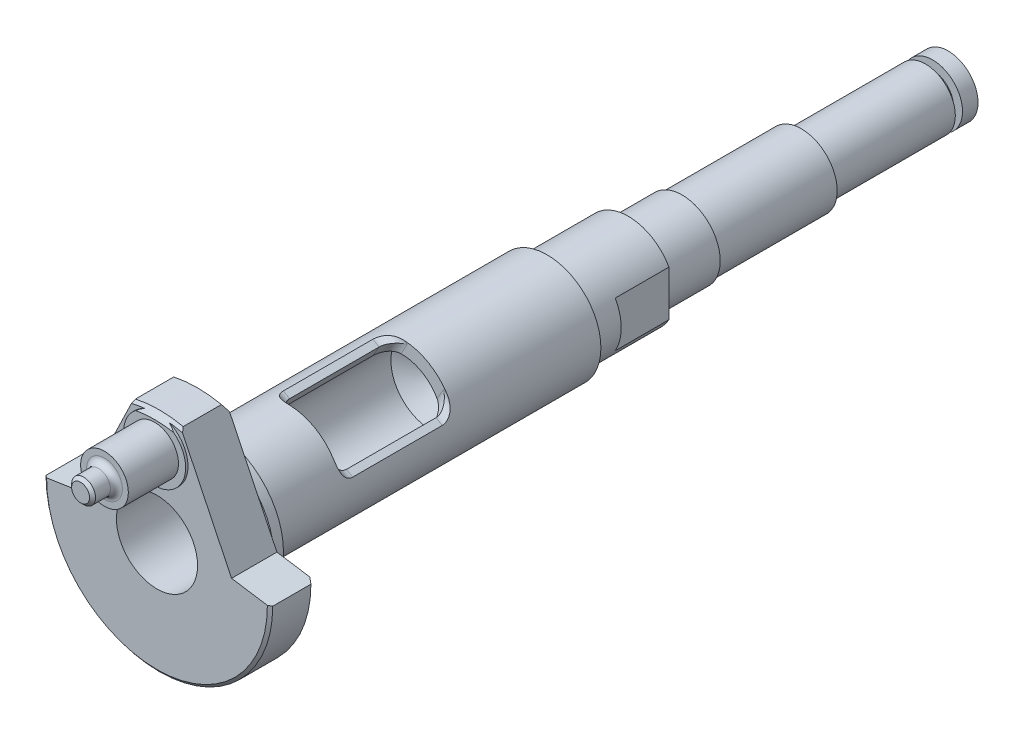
ISO-10303-21;
HEADER;
FILE_DESCRIPTION(('STEP AP214'),'2;1');
FILE_NAME('part.step','',(''),(''),'','','');
FILE_SCHEMA(('AUTOMOTIVE_DESIGN { 1 0 10303 214 1 1 1 1 }'));
ENDSEC;
DATA;
#1=APPLICATION_CONTEXT('core data for automotive mechanical design processes');
#2=APPLICATION_PROTOCOL_DEFINITION('international standard','automotive_design',2000,#1);
#3=PRODUCT_CONTEXT('',#1,'mechanical');
#4=PRODUCT('Part','Part','',(#3));
#5=PRODUCT_RELATED_PRODUCT_CATEGORY('part','',(#4));
#6=PRODUCT_DEFINITION_FORMATION('','',#4);
#7=PRODUCT_DEFINITION_CONTEXT('part definition',#1,'design');
#8=PRODUCT_DEFINITION('design','',#6,#7);
#9=PRODUCT_DEFINITION_SHAPE('','',#8);
#10=(LENGTH_UNIT() NAMED_UNIT(*) SI_UNIT(.MILLI.,.METRE.));
#11=(NAMED_UNIT(*) PLANE_ANGLE_UNIT() SI_UNIT($,.RADIAN.));
#12=(NAMED_UNIT(*) SI_UNIT($,.STERADIAN.) SOLID_ANGLE_UNIT());
#13=UNCERTAINTY_MEASURE_WITH_UNIT(LENGTH_MEASURE(1.E-05),#10,'distance_accuracy_value','');
#14=(GEOMETRIC_REPRESENTATION_CONTEXT(3) GLOBAL_UNCERTAINTY_ASSIGNED_CONTEXT((#13)) GLOBAL_UNIT_ASSIGNED_CONTEXT((#10,
#11,#12)) REPRESENTATION_CONTEXT('',''));
#15=CARTESIAN_POINT('',(0.,0.,0.));
#16=DIRECTION('',(0.,0.,1.));
#17=DIRECTION('',(1.,0.,0.));
#18=AXIS2_PLACEMENT_3D('',#15,#16,#17);
#19=CARTESIAN_POINT('',(0.,0.,-3.8));
#20=DIRECTION('',(0.,0.,1.));
#21=DIRECTION('',(1.,0.,0.));
#22=AXIS2_PLACEMENT_3D('',#19,#20,#21);
#23=CYLINDRICAL_SURFACE('',#22,9.5);
#24=DIRECTION('',(0.,0.,1.));
#25=VECTOR('',#24,1.);
#26=CARTESIAN_POINT('',(-9.5,0.,-3.8));
#27=LINE('',#26,#25);
#28=CARTESIAN_POINT('',(-9.5,0.,-3.4));
#29=VERTEX_POINT('',#28);
#30=CARTESIAN_POINT('',(-9.5,0.,-0.2));
#31=VERTEX_POINT('',#30);
#32=EDGE_CURVE('E663',#29,#31,#27,.T.);
#33=ORIENTED_EDGE('',*,*,#32,.F.);
#34=CARTESIAN_POINT('',(0.,0.,-3.4));
#35=DIRECTION('',(0.,0.,1.));
#36=DIRECTION('',(1.,0.,0.));
#37=AXIS2_PLACEMENT_3D('',#34,#35,#36);
#38=CIRCLE('',#37,9.5);
#39=CARTESIAN_POINT('',(9.5,0.,-3.4));
#40=VERTEX_POINT('',#39);
#41=EDGE_CURVE('E567',#29,#40,#38,.T.);
#42=ORIENTED_EDGE('',*,*,#41,.T.);
#43=DIRECTION('',(0.,0.,1.));
#44=VECTOR('',#43,1.);
#45=CARTESIAN_POINT('',(9.5,0.,-3.8));
#46=LINE('',#45,#44);
#47=CARTESIAN_POINT('',(9.5,0.,-0.200000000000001));
#48=VERTEX_POINT('',#47);
#49=EDGE_CURVE('E689',#40,#48,#46,.T.);
#50=ORIENTED_EDGE('',*,*,#49,.T.);
#51=CARTESIAN_POINT('',(0.,0.,-0.2));
#52=DIRECTION('',(0.,0.,1.));
#53=DIRECTION('',(1.,0.,0.));
#54=AXIS2_PLACEMENT_3D('',#51,#52,#53);
#55=CIRCLE('',#54,9.5);
#56=EDGE_CURVE('E666',#31,#48,#55,.T.);
#57=ORIENTED_EDGE('',*,*,#56,.F.);
#58=EDGE_LOOP('',(#33,#42,#50,#57));
#59=FACE_BOUND('',#58,.T.);
#60=ADVANCED_FACE('F352',(#59),#23,.T.);
#61=CARTESIAN_POINT('',(-6.25,0.5,-3.8));
#62=DIRECTION('',(-0.152057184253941,0.988371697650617,0.));
#63=DIRECTION('',(-0.988371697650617,-0.152057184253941,0.));
#64=AXIS2_PLACEMENT_3D('',#61,#62,#63);
#65=PLANE('',#64);
#66=DIRECTION('',(-0.988371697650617,-0.152057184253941,0.));
#67=VECTOR('',#66,1.);
#68=CARTESIAN_POINT('',(-6.25,0.5,-3.8));
#69=LINE('',#68,#67);
#70=CARTESIAN_POINT('',(-6.25,0.5,-3.8));
#71=VERTEX_POINT('',#70);
#72=CARTESIAN_POINT('',(-8.99967082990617,0.0769737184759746,-3.8));
#73=VERTEX_POINT('',#72);
#74=EDGE_CURVE('E680',#71,#73,#69,.T.);
#75=ORIENTED_EDGE('',*,*,#74,.T.);
#76=CARTESIAN_POINT('',(-8.99942049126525,0.0770122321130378,-3.8002));
#77=CARTESIAN_POINT('',(-9.08290545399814,0.0641683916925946,-3.73350113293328));
#78=CARTESIAN_POINT('',(-9.16637956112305,0.0513262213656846,-3.66678836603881));
#79=CARTESIAN_POINT('',(-9.3333060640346,0.0256452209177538,-3.53333503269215));
#80=CARTESIAN_POINT('',(-9.41675845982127,0.012806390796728,-3.46659446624));
#81=CARTESIAN_POINT('',(-9.5002,-3.07692307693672E-05,-3.39983999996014));
#82=B_SPLINE_CURVE_WITH_KNOTS('',3,(#76,#77,#78,#79,#80,#81),.UNSPECIFIED.,.F.,.F.,(4,2,4),(0.,
0.322879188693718,0.645758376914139),.UNSPECIFIED.);
#83=EDGE_CURVE('E373',#73,#29,#82,.T.);
#84=ORIENTED_EDGE('',*,*,#83,.T.);
#85=ORIENTED_EDGE('',*,*,#32,.T.);
#86=CARTESIAN_POINT('',(-9.5002,-3.07692307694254E-05,-0.200160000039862));
#87=CARTESIAN_POINT('',(-9.45845018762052,0.00639227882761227,-0.166759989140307));
#88=CARTESIAN_POINT('',(-9.41669776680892,0.0128157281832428,-0.133363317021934));
#89=CARTESIAN_POINT('',(-9.33318770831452,0.0256634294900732,-0.0665766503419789));
#90=CARTESIAN_POINT('',(-9.29143007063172,0.0320876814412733,-0.0331866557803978));
#91=CARTESIAN_POINT('',(-9.2496698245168,0.0385123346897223,0.000200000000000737));
#92=B_SPLINE_CURVE_WITH_KNOTS('',3,(#86,#87,#88,#89,#90,#91),.UNSPECIFIED.,.F.,.F.,(4,2,4),(0.,
0.161551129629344,0.323102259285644),.UNSPECIFIED.);
#93=CARTESIAN_POINT('',(-9.24991998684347,0.0384738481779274,0.));
#94=VERTEX_POINT('',#93);
#95=EDGE_CURVE('E1047',#31,#94,#92,.T.);
#96=ORIENTED_EDGE('',*,*,#95,.T.);
#97=DIRECTION('',(-0.988371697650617,-0.152057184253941,0.));
#98=VECTOR('',#97,1.);
#99=CARTESIAN_POINT('',(-6.25,0.5,0.));
#100=LINE('',#99,#98);
#101=CARTESIAN_POINT('',(-6.25,0.5,0.));
#102=VERTEX_POINT('',#101);
#103=EDGE_CURVE('E1015',#102,#94,#100,.T.);
#104=ORIENTED_EDGE('',*,*,#103,.F.);
#105=DIRECTION('',(0.,0.,1.));
#106=VECTOR('',#105,1.);
#107=CARTESIAN_POINT('',(-6.25,0.5,-3.8));
#108=LINE('',#107,#106);
#109=EDGE_CURVE('E670',#71,#102,#108,.T.);
#110=ORIENTED_EDGE('',*,*,#109,.F.);
#111=EDGE_LOOP('',(#75,#84,#85,#96,#104,#110));
#112=FACE_BOUND('',#111,.T.);
#113=ADVANCED_FACE('F614',(#112),#65,.T.);
#114=CARTESIAN_POINT('',(-2.,9.28708781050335,-3.8));
#115=DIRECTION('',(-0.900232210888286,0.435410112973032,0.));
#116=DIRECTION('',(-0.435410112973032,-0.900232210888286,0.));
#117=AXIS2_PLACEMENT_3D('',#114,#115,#116);
#118=PLANE('',#117);
#119=DIRECTION('',(0.,0.,1.));
#120=VECTOR('',#119,1.);
#121=CARTESIAN_POINT('',(-2.,9.28708781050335,-3.8));
#122=LINE('',#121,#120);
#123=CARTESIAN_POINT('',(-2.,9.28708781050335,-3.4));
#124=VERTEX_POINT('',#123);
#125=CARTESIAN_POINT('',(-2.,9.28708781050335,-0.2));
#126=VERTEX_POINT('',#125);
#127=EDGE_CURVE('E677',#124,#126,#122,.T.);
#128=ORIENTED_EDGE('',*,*,#127,.F.);
#129=CARTESIAN_POINT('',(0.835076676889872,15.1487508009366,1.13740015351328));
#130=CARTESIAN_POINT('',(0.735372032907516,14.9426064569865,0.968348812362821));
#131=CARTESIAN_POINT('',(0.63554122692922,14.7362012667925,0.799689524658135));
#132=CARTESIAN_POINT('',(0.435586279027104,14.3227843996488,0.463286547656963));
#133=CARTESIAN_POINT('',(0.335462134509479,14.1157727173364,0.295542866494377));
#134=CARTESIAN_POINT('',(0.0344708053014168,13.4934580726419,-0.206313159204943));
#135=CARTESIAN_POINT('',(-0.166896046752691,13.0771220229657,-0.538847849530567));
#136=CARTESIAN_POINT('',(-0.578023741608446,12.2270949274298,-1.20900978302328));
#137=CARTESIAN_POINT('',(-0.787843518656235,11.7932820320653,-1.54644717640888));
#138=CARTESIAN_POINT('',(-1.10448947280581,11.1386006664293,-2.04596485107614));
#139=CARTESIAN_POINT('',(-1.21033357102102,10.9197626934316,-2.21132802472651));
#140=CARTESIAN_POINT('',(-1.42280426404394,10.480468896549,-2.53937838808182));
#141=CARTESIAN_POINT('',(-1.52943084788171,10.2600130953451,-2.70206561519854));
#142=CARTESIAN_POINT('',(-1.74364033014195,9.81712426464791,-3.02418738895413));
#143=CARTESIAN_POINT('',(-1.85122339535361,9.59469089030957,-3.18362135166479));
#144=CARTESIAN_POINT('',(-2.0675228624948,9.14748091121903,-3.49840330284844));
#145=CARTESIAN_POINT('',(-2.17623928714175,8.92270425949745,-3.65375120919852));
#146=CARTESIAN_POINT('',(-2.39522403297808,8.4699423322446,-3.95953420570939));
#147=CARTESIAN_POINT('',(-2.50549461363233,8.24195238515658,-4.1099607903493));
#148=CARTESIAN_POINT('',(-2.72770672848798,7.78251771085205,-4.40416421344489));
#149=CARTESIAN_POINT('',(-2.83964819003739,7.55107313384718,-4.54794133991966));
#150=CARTESIAN_POINT('',(-3.06396837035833,7.08727992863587,-4.82487371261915));
#151=CARTESIAN_POINT('',(-3.1763184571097,6.85499049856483,-4.95815052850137));
#152=CARTESIAN_POINT('',(-3.40342491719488,6.3854365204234,-5.21369511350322));
#153=CARTESIAN_POINT('',(-3.51818188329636,6.14817074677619,-5.33596013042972));
#154=CARTESIAN_POINT('',(-3.75013646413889,5.66859303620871,-5.56551794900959));
#155=CARTESIAN_POINT('',(-3.86732601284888,5.42629777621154,-5.67285324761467));
#156=CARTESIAN_POINT('',(-4.10468374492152,4.93554877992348,-5.86821209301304));
#157=CARTESIAN_POINT('',(-4.22484956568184,4.68709992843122,-5.95625044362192));
#158=CARTESIAN_POINT('',(-4.43988815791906,4.24249687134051,-6.08988402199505));
#159=CARTESIAN_POINT('',(-4.53415400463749,4.0475975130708,-6.1405878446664));
#160=CARTESIAN_POINT('',(-4.72416610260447,3.65473798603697,-6.22472604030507));
#161=CARTESIAN_POINT('',(-4.81991237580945,3.45677777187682,-6.25816015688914));
#162=CARTESIAN_POINT('',(-5.01186802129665,3.05989986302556,-6.305535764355));
#163=CARTESIAN_POINT('',(-5.10807297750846,2.86099129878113,-6.31956987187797));
#164=CARTESIAN_POINT('',(-5.30064187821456,2.46284545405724,-6.32745557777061));
#165=CARTESIAN_POINT('',(-5.39700581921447,2.26360818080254,-6.32130761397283));
#166=CARTESIAN_POINT('',(-5.58852581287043,1.86763100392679,-6.28936938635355));
#167=CARTESIAN_POINT('',(-5.68368563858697,1.67088329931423,-6.26369549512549));
#168=CARTESIAN_POINT('',(-5.87278170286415,1.27991771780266,-6.1945088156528));
#169=CARTESIAN_POINT('',(-5.96671756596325,1.08570061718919,-6.15099068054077));
#170=CARTESIAN_POINT('',(-6.10696579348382,0.795730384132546,-6.07382373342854));
#171=CARTESIAN_POINT('',(-6.15389659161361,0.698698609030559,-6.04590761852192));
#172=CARTESIAN_POINT('',(-6.24730729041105,0.505567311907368,-5.98646111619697));
#173=CARTESIAN_POINT('',(-6.29378732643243,0.409467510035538,-5.95493185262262));
#174=CARTESIAN_POINT('',(-6.43254997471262,0.12256878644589,-5.85540607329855));
#175=CARTESIAN_POINT('',(-6.52416310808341,-0.0668459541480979,-5.78246706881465));
#176=CARTESIAN_POINT('',(-6.72810825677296,-0.488512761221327,-5.6064742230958));
#177=CARTESIAN_POINT('',(-6.83994662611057,-0.719744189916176,-5.50043729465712));
#178=CARTESIAN_POINT('',(-7.0611819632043,-1.17715932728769,-5.27559922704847));
#179=CARTESIAN_POINT('',(-7.17057802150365,-1.40334115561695,-5.15679342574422));
#180=CARTESIAN_POINT('',(-7.38750273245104,-1.85184385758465,-4.90914923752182));
#181=CARTESIAN_POINT('',(-7.49502634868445,-2.07415431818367,-4.78028775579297));
#182=CARTESIAN_POINT('',(-7.70827026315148,-2.5150467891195,-4.51504237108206));
#183=CARTESIAN_POINT('',(-7.81399080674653,-2.73362930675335,-4.37865950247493));
#184=CARTESIAN_POINT('',(-8.01857541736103,-3.15661823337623,-4.10713832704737));
#185=CARTESIAN_POINT('',(-8.11751358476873,-3.3611778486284,-3.97229321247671));
#186=CARTESIAN_POINT('',(-8.31427297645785,-3.7679877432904,-3.6983553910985));
#187=CARTESIAN_POINT('',(-8.41209414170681,-3.97023790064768,-3.55926246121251));
#188=CARTESIAN_POINT('',(-8.60622898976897,-4.371621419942,-3.27846986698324));
#189=CARTESIAN_POINT('',(-8.70254812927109,-4.57076606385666,-3.13679004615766));
#190=CARTESIAN_POINT('',(-8.89437907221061,-4.96738614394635,-2.85065099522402));
#191=CARTESIAN_POINT('',(-8.98989100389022,-5.1648618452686,-2.70619221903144));
#192=CARTESIAN_POINT('',(-9.08507667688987,-5.36166299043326,-2.56062378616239));
#193=B_SPLINE_CURVE_WITH_KNOTS('',3,(#129,#130,#131,#132,#133,#134,#135,#136,#137,#138,#139,
#140,#141,#142,#143,#144,#145,#146,#147,#148,#149,#150,#151,#152,#153,#154,#155,#156,#157,#158,
#159,#160,#161,#162,#163,#164,#165,#166,#167,#168,#169,#170,#171,#172,#173,#174,#175,#176,#177,
#178,#179,#180,#181,#182,#183,#184,#185,#186,#187,#188,#189,#190,#191,#192),.UNSPECIFIED.,.F.,
.F.,(4,2,2,2,2,2,2,2,2,2,2,2,2,2,2,2,2,2,2,2,2,2,2,2,2,2,2,2,2,2,2,4),(0.,0.853893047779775,
1.70779366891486,3.41661683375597,5.1814005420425,6.06339716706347,6.94538145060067,
7.82752267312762,8.70968161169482,9.59329228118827,10.4768646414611,11.3479267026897,
12.2192058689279,13.087951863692,13.9560290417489,14.6225099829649,15.2890008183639,
15.9522986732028,16.6155821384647,17.2749431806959,17.9345019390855,18.2684746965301,
18.6023438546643,19.2700256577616,20.1032210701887,20.9367217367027,21.7721964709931,
22.6075565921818,23.4001860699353,24.192857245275,24.9809224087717,25.7688599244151),.UNSPECIFIED.);
#194=CARTESIAN_POINT('',(-2.28097604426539,8.70615576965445,-3.8));
#195=VERTEX_POINT('',#194);
#196=EDGE_CURVE('E598',#124,#195,#193,.T.);
#197=ORIENTED_EDGE('',*,*,#196,.T.);
#198=DIRECTION('',(-0.435410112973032,-0.900232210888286,0.));
#199=VECTOR('',#198,1.);
#200=CARTESIAN_POINT('',(-2.,9.28708781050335,-3.8));
#201=LINE('',#200,#199);
#202=CARTESIAN_POINT('',(-4.66954285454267,3.76767428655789,-3.8));
#203=VERTEX_POINT('',#202);
#204=EDGE_CURVE('E1025',#195,#203,#201,.T.);
#205=ORIENTED_EDGE('',*,*,#204,.T.);
#206=CARTESIAN_POINT('',(-5.85265277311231,1.32153528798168,-3.8));
#207=VERTEX_POINT('',#206);
#208=EDGE_CURVE('E1026',#203,#207,#201,.T.);
#209=ORIENTED_EDGE('',*,*,#208,.T.);
#210=EDGE_CURVE('E1023',#207,#71,#201,.T.);
#211=ORIENTED_EDGE('',*,*,#210,.T.);
#212=ORIENTED_EDGE('',*,*,#109,.T.);
#213=DIRECTION('',(-0.435410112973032,-0.900232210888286,0.));
#214=VECTOR('',#213,1.);
#215=CARTESIAN_POINT('',(-2.,9.28708781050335,0.));
#216=LINE('',#215,#214);
#217=CARTESIAN_POINT('',(-2.13922442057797,8.99923434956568,0.));
#218=VERTEX_POINT('',#217);
#219=EDGE_CURVE('E1013',#218,#102,#216,.T.);
#220=ORIENTED_EDGE('',*,*,#219,.F.);
#221=CARTESIAN_POINT('',(-9.08329377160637,-5.3579767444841,-1.03664921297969));
#222=CARTESIAN_POINT('',(-9.00899755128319,-5.20436558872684,-0.923030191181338));
#223=CARTESIAN_POINT('',(-8.93450012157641,-5.05033842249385,-0.810099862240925));
#224=CARTESIAN_POINT('',(-8.78503692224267,-4.74131577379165,-0.585869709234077));
#225=CARTESIAN_POINT('',(-8.71007113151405,-4.58632024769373,-0.474569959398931));
#226=CARTESIAN_POINT('',(-8.55951050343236,-4.27502861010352,-0.253715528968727));
#227=CARTESIAN_POINT('',(-8.48391495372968,-4.11873102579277,-0.144163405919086));
#228=CARTESIAN_POINT('',(-8.33211923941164,-3.80488578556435,0.0727097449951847));
#229=CARTESIAN_POINT('',(-8.25591907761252,-3.64733813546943,0.180030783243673));
#230=CARTESIAN_POINT('',(-8.10043575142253,-3.32586857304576,0.395349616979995));
#231=CARTESIAN_POINT('',(-8.02113061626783,-3.16190123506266,0.503263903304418));
#232=CARTESIAN_POINT('',(-7.86167383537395,-2.83221635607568,0.715739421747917));
#233=CARTESIAN_POINT('',(-7.78152220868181,-2.6664988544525,0.820300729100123));
#234=CARTESIAN_POINT('',(-7.62027641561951,-2.33311510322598,1.02534147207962));
#235=CARTESIAN_POINT('',(-7.53918266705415,-2.16544971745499,1.12582263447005));
#236=CARTESIAN_POINT('',(-7.3758813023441,-1.827815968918,1.32187415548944));
#237=CARTESIAN_POINT('',(-7.29367375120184,-1.65784774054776,1.41744479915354));
#238=CARTESIAN_POINT('',(-7.10062863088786,-1.2587172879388,1.633178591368));
#239=CARTESIAN_POINT('',(-6.98929894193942,-1.02853758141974,1.75104454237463));
#240=CARTESIAN_POINT('',(-6.76398735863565,-0.562694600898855,1.97293006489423));
#241=CARTESIAN_POINT('',(-6.65000477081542,-0.327029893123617,2.07694596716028));
#242=CARTESIAN_POINT('',(-6.42022560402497,0.148050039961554,2.26588958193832));
#243=CARTESIAN_POINT('',(-6.30445562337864,0.387410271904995,2.35098525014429));
#244=CARTESIAN_POINT('',(-6.07021809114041,0.871708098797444,2.49816181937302));
#245=CARTESIAN_POINT('',(-5.95175321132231,1.11664016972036,2.56026454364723));
#246=CARTESIAN_POINT('',(-5.73732875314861,1.55997347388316,2.64654292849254));
#247=CARTESIAN_POINT('',(-5.6417673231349,1.75755151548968,2.6758994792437));
#248=CARTESIAN_POINT('',(-5.44988747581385,2.15427270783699,2.71509462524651));
#249=CARTESIAN_POINT('',(-5.35356920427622,2.35341555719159,2.72493689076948));
#250=CARTESIAN_POINT('',(-5.16094783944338,2.75166987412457,2.72440226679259));
#251=CARTESIAN_POINT('',(-5.06464474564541,2.95078134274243,2.71402633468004));
#252=CARTESIAN_POINT('',(-4.87281359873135,3.3474018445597,2.67380486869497));
#253=CARTESIAN_POINT('',(-4.77728570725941,3.54491054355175,2.64395537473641));
#254=CARTESIAN_POINT('',(-4.55034636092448,4.01411900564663,2.55148822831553));
#255=CARTESIAN_POINT('',(-4.41957605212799,4.28449316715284,2.48060548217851));
#256=CARTESIAN_POINT('',(-4.16141803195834,4.81824780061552,2.31161028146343));
#257=CARTESIAN_POINT('',(-4.03403287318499,5.08162299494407,2.21347788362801));
#258=CARTESIAN_POINT('',(-3.84464223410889,5.47319762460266,2.05012787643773));
#259=CARTESIAN_POINT('',(-3.78135603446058,5.6040450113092,1.99252431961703));
#260=CARTESIAN_POINT('',(-3.65560576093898,5.86403999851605,1.87274935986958));
#261=CARTESIAN_POINT('',(-3.59314169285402,5.99318758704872,1.81057792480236));
#262=CARTESIAN_POINT('',(-3.46900626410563,6.24984380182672,1.68234106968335));
#263=CARTESIAN_POINT('',(-3.40733463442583,6.37735298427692,1.61627701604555));
#264=CARTESIAN_POINT('',(-3.28469945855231,6.63090735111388,1.48078230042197));
#265=CARTESIAN_POINT('',(-3.2237359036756,6.7569525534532,1.41135167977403));
#266=CARTESIAN_POINT('',(-3.07047049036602,7.07383646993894,1.2322140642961));
#267=CARTESIAN_POINT('',(-2.97859658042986,7.2637903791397,1.12057620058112));
#268=CARTESIAN_POINT('',(-2.79613091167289,7.64104728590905,0.89188828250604));
#269=CARTESIAN_POINT('',(-2.70553927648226,7.82835002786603,0.774837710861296));
#270=CARTESIAN_POINT('',(-2.52542628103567,8.20074266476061,0.536326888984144));
#271=CARTESIAN_POINT('',(-2.43590528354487,8.38583180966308,0.414865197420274));
#272=CARTESIAN_POINT('',(-2.25780070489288,8.75407194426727,0.168363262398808));
#273=CARTESIAN_POINT('',(-2.16921715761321,8.93722286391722,0.0433228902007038));
#274=CARTESIAN_POINT('',(-1.90434948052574,9.48485004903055,-0.336638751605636));
#275=CARTESIAN_POINT('',(-1.72926612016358,9.84684366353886,-0.59597349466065));
#276=CARTESIAN_POINT('',(-1.38144606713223,10.5659790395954,-1.12281311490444));
#277=CARTESIAN_POINT('',(-1.20870952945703,10.9231204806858,-1.39031852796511));
#278=CARTESIAN_POINT('',(-0.95764232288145,11.4422145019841,-1.78547077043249));
#279=CARTESIAN_POINT('',(-0.878612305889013,11.6056130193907,-1.91078248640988));
#280=CARTESIAN_POINT('',(-0.720889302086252,11.9317132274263,-2.16250669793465));
#281=CARTESIAN_POINT('',(-0.642196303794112,12.0944149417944,-2.28891915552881));
#282=CARTESIAN_POINT('',(-0.406548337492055,12.5816289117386,-2.66961641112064));
#283=CARTESIAN_POINT('',(-0.250035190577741,12.9052276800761,-2.92534404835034));
#284=CARTESIAN_POINT('',(0.0613758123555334,13.5490855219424,-3.43864467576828));
#285=CARTESIAN_POINT('',(0.216277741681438,13.8693530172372,-3.69620466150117));
#286=CARTESIAN_POINT('',(0.525314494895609,14.5083019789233,-4.21367001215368));
#287=CARTESIAN_POINT('',(0.679449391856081,14.8269835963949,-4.47357514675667));
#288=CARTESIAN_POINT('',(0.833293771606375,15.1450645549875,-4.73437718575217));
#289=B_SPLINE_CURVE_WITH_KNOTS('',3,(#221,#222,#223,#224,#225,#226,#227,#228,#229,#230,#231,
#232,#233,#234,#235,#236,#237,#238,#239,#240,#241,#242,#243,#244,#245,#246,#247,#248,#249,#250,
#251,#252,#253,#254,#255,#256,#257,#258,#259,#260,#261,#262,#263,#264,#265,#266,#267,#268,#269,
#270,#271,#272,#273,#274,#275,#276,#277,#278,#279,#280,#281,#282,#283,#284,#285,#286,#287,#288),
.UNSPECIFIED.,.F.,.F.,(4,2,2,2,2,2,2,2,2,2,2,2,2,2,2,2,2,2,2,2,2,2,2,2,2,2,2,2,2,2,2,2,2,4),(0.,
0.615007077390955,1.23004206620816,1.84590700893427,2.46176908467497,3.09686174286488,
3.73194014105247,4.36674690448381,5.00151677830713,5.84584449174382,6.69039544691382,
7.5271200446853,8.36304843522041,9.02655131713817,9.68992939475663,10.3532760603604,
11.0167576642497,11.9408046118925,12.8655296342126,13.3345091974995,13.8034920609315,
14.2723112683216,14.7411247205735,15.4571720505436,16.1732879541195,16.8896399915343,
17.6060178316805,19.0413093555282,20.4766952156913,21.1383795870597,21.8000412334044,
23.1234547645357,24.4410666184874,25.7585504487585),.UNSPECIFIED.);
#290=EDGE_CURVE('E620',#218,#126,#289,.T.);
#291=ORIENTED_EDGE('',*,*,#290,.T.);
#292=EDGE_LOOP('',(#128,#197,#205,#209,#211,#212,#220,#291));
#293=FACE_BOUND('',#292,.T.);
#294=ADVANCED_FACE('F609',(#293),#118,.T.);
#295=CARTESIAN_POINT('',(0.,0.,-3.8));
#296=DIRECTION('',(0.,0.,1.));
#297=DIRECTION('',(1.,0.,0.));
#298=AXIS2_PLACEMENT_3D('',#295,#296,#297);
#299=CYLINDRICAL_SURFACE('',#298,9.5);
#300=DIRECTION('',(0.,0.,1.));
#301=VECTOR('',#300,1.);
#302=CARTESIAN_POINT('',(2.,9.28708781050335,-3.8));
#303=LINE('',#302,#301);
#304=CARTESIAN_POINT('',(2.,9.28708781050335,-3.4));
#305=VERTEX_POINT('',#304);
#306=CARTESIAN_POINT('',(2.,9.28708781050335,-0.2));
#307=VERTEX_POINT('',#306);
#308=EDGE_CURVE('E684',#305,#307,#303,.T.);
#309=ORIENTED_EDGE('',*,*,#308,.F.);
#310=EDGE_CURVE('E570',#305,#124,#38,.T.);
#311=ORIENTED_EDGE('',*,*,#310,.T.);
#312=ORIENTED_EDGE('',*,*,#127,.T.);
#313=EDGE_CURVE('E1048',#307,#126,#55,.T.);
#314=ORIENTED_EDGE('',*,*,#313,.F.);
#315=EDGE_LOOP('',(#309,#311,#312,#314));
#316=FACE_BOUND('',#315,.T.);
#317=ADVANCED_FACE('F613',(#316),#299,.T.);
#318=CARTESIAN_POINT('',(2.,9.28708781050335,-3.8));
#319=DIRECTION('',(0.900232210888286,0.435410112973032,0.));
#320=DIRECTION('',(-0.435410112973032,0.900232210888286,0.));
#321=AXIS2_PLACEMENT_3D('',#318,#319,#320);
#322=PLANE('',#321);
#323=DIRECTION('',(-0.435410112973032,0.900232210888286,0.));
#324=VECTOR('',#323,1.);
#325=CARTESIAN_POINT('',(2.,9.28708781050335,-3.8));
#326=LINE('',#325,#324);
#327=CARTESIAN_POINT('',(4.66954285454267,3.76767428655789,-3.8));
#328=VERTEX_POINT('',#327);
#329=CARTESIAN_POINT('',(2.28097604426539,8.70615576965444,-3.8));
#330=VERTEX_POINT('',#329);
#331=EDGE_CURVE('E1020',#328,#330,#326,.T.);
#332=ORIENTED_EDGE('',*,*,#331,.T.);
#333=CARTESIAN_POINT('',(9.08507667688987,-5.36166299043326,-2.56062378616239));
#334=CARTESIAN_POINT('',(9.01078894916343,-5.20806939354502,-2.67424610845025));
#335=CARTESIAN_POINT('',(8.936300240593,-5.05406025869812,-2.78718060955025));
#336=CARTESIAN_POINT('',(8.7868550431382,-4.74507482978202,-3.01142129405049));
#337=CARTESIAN_POINT('',(8.71189853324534,-4.59009849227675,-3.12272740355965));
#338=CARTESIAN_POINT('',(8.56135748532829,-4.27884733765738,-3.34359669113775));
#339=CARTESIAN_POINT('',(8.48577223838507,-4.12257105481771,-3.4531573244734));
#340=CARTESIAN_POINT('',(8.33399788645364,-3.8087699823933,-3.67005081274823));
#341=CARTESIAN_POINT('',(8.25780878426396,-3.65124519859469,-3.77738367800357));
#342=CARTESIAN_POINT('',(8.1023506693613,-3.32982776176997,-3.99272814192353));
#343=CARTESIAN_POINT('',(8.0230597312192,-3.16588977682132,-4.10065642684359));
#344=CARTESIAN_POINT('',(7.86363247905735,-2.83626594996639,-4.31316559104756));
#345=CARTESIAN_POINT('',(7.7834961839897,-2.67058014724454,-4.41774654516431));
#346=CARTESIAN_POINT('',(7.6222822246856,-2.33726221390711,-4.6228338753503));
#347=CARTESIAN_POINT('',(7.54120497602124,-2.16963094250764,-4.7233419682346));
#348=CARTESIAN_POINT('',(7.37793805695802,-1.83206841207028,-4.91945636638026));
#349=CARTESIAN_POINT('',(7.29574845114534,-1.66213728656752,-5.0150629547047));
#350=CARTESIAN_POINT('',(7.10263394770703,-1.26286338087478,-5.23102022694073));
#351=CARTESIAN_POINT('',(6.9912152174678,-1.03249957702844,-5.34906728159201));
#352=CARTESIAN_POINT('',(6.76572236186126,-0.566281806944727,-5.57131009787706));
#353=CARTESIAN_POINT('',(6.65164753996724,-0.330426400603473,-5.67550217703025));
#354=CARTESIAN_POINT('',(6.42167975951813,0.145043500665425,-5.8647846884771));
#355=CARTESIAN_POINT('',(6.30581343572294,0.384602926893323,-5.95004314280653));
#356=CARTESIAN_POINT('',(6.07137714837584,0.869311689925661,-6.09752123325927));
#357=CARTESIAN_POINT('',(5.95280986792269,1.11445547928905,-6.15976275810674));
#358=CARTESIAN_POINT('',(5.73827492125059,1.55801722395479,-6.24622244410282));
#359=CARTESIAN_POINT('',(5.64270772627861,1.7556071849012,-6.27564357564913));
#360=CARTESIAN_POINT('',(5.45081390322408,2.15235727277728,-6.31496848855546));
#361=CARTESIAN_POINT('',(5.35448742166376,2.35151709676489,-6.32487594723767));
#362=CARTESIAN_POINT('',(5.16184827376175,2.74980818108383,-6.32446765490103));
#363=CARTESIAN_POINT('',(5.06553560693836,2.94893944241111,-6.31415311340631));
#364=CARTESIAN_POINT('',(4.87368328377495,3.34560372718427,-6.2740467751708));
#365=CARTESIAN_POINT('',(4.77814378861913,3.54313641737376,-6.24425101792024));
#366=CARTESIAN_POINT('',(4.55124792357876,4.01225497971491,-6.15193008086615));
#367=CARTESIAN_POINT('',(4.42053072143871,4.28251934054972,-6.08115388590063));
#368=CARTESIAN_POINT('',(4.16247504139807,4.8160623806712,-5.91237855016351));
#369=CARTESIAN_POINT('',(4.03513910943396,5.07933579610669,-5.81435949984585));
#370=CARTESIAN_POINT('',(3.84581990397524,5.47076273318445,-5.65117980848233));
#371=CARTESIAN_POINT('',(3.78255678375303,5.60156240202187,-5.59363295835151));
#372=CARTESIAN_POINT('',(3.65685225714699,5.86146280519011,-5.47397103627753));
#373=CARTESIAN_POINT('',(3.59441085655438,5.9905635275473,-5.41185593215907));
#374=CARTESIAN_POINT('',(3.47032045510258,6.24712664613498,-5.28373107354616));
#375=CARTESIAN_POINT('',(3.40867118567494,6.37458959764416,-5.21772268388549));
#376=CARTESIAN_POINT('',(3.286080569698,6.62805183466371,-5.08233857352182));
#377=CARTESIAN_POINT('',(3.22513921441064,6.75405113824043,-5.01296289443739));
#378=CARTESIAN_POINT('',(3.07180754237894,7.07107204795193,-4.8338203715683));
#379=CARTESIAN_POINT('',(2.97984708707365,7.26120489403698,-4.72211322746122));
#380=CARTESIAN_POINT('',(2.79721139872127,7.63881332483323,-4.49327232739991));
#381=CARTESIAN_POINT('',(2.70653629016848,7.82628865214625,-4.37613805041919));
#382=CARTESIAN_POINT('',(2.5262587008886,8.19902159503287,-4.13744894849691));
#383=CARTESIAN_POINT('',(2.43665658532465,8.38427845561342,-4.01589267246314));
#384=CARTESIAN_POINT('',(2.25839177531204,8.75284987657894,-3.76919354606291));
#385=CARTESIAN_POINT('',(2.16972911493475,8.93616436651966,-3.64405056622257));
#386=CARTESIAN_POINT('',(1.90462515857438,9.48428007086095,-3.26377027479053));
#387=CARTESIAN_POINT('',(1.72938704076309,9.84659365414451,-3.00421041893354));
#388=CARTESIAN_POINT('',(1.38126150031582,10.5663606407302,-2.47690657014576));
#389=CARTESIAN_POINT('',(1.20837423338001,10.9238137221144,-2.20916203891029));
#390=CARTESIAN_POINT('',(0.957101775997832,11.4433321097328,-1.813674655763));
#391=CARTESIAN_POINT('',(0.878016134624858,11.6068456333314,-1.68827052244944));
#392=CARTESIAN_POINT('',(0.720182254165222,11.933175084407,-1.43636032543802));
#393=CARTESIAN_POINT('',(0.641434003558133,12.095991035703,-1.30985429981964));
#394=CARTESIAN_POINT('',(0.405620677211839,12.5835468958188,-0.928874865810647));
#395=CARTESIAN_POINT('',(0.248997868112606,12.9073723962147,-0.672957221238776));
#396=CARTESIAN_POINT('',(-0.0626291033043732,13.5516767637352,-0.159278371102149));
#397=CARTESIAN_POINT('',(-0.217637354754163,13.8721640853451,0.0984697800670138));
#398=CARTESIAN_POINT('',(-0.526886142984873,14.5115514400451,0.616313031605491));
#399=CARTESIAN_POINT('',(-0.681126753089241,14.8304516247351,0.876407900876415));
#400=CARTESIAN_POINT('',(-0.835076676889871,15.1487508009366,1.13740015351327));
#401=B_SPLINE_CURVE_WITH_KNOTS('',3,(#333,#334,#335,#336,#337,#338,#339,#340,#341,#342,#343,
#344,#345,#346,#347,#348,#349,#350,#351,#352,#353,#354,#355,#356,#357,#358,#359,#360,#361,#362,
#363,#364,#365,#366,#367,#368,#369,#370,#371,#372,#373,#374,#375,#376,#377,#378,#379,#380,#381,
#382,#383,#384,#385,#386,#387,#388,#389,#390,#391,#392,#393,#394,#395,#396,#397,#398,#399,#400),
.UNSPECIFIED.,.F.,.F.,(4,2,2,2,2,2,2,2,2,2,2,2,2,2,2,2,2,2,2,2,2,2,2,2,2,2,2,2,2,2,2,2,2,4),(0.,
0.614963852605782,1.22995552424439,1.84577409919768,2.46158982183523,3.09661982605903,
3.73163562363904,4.36638090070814,5.00108947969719,5.84620188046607,6.69153845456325,
7.5290435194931,8.3657500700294,9.0293183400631,9.69276154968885,10.3561650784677,
11.019703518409,11.9433218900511,12.8676170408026,13.3363860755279,13.8051584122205,
14.2737673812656,14.7423705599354,15.4590416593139,16.1757817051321,16.8927591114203,
17.6097624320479,19.0463155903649,20.482963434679,21.1451207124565,21.8072551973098,
23.1316148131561,24.4501510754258,25.7685588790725),.UNSPECIFIED.);
#402=EDGE_CURVE('E366',#330,#305,#401,.T.);
#403=ORIENTED_EDGE('',*,*,#402,.T.);
#404=ORIENTED_EDGE('',*,*,#308,.T.);
#405=CARTESIAN_POINT('',(-0.833293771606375,15.1450645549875,-4.73437718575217));
#406=CARTESIAN_POINT('',(-0.733614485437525,14.9389726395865,-4.56537617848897));
#407=CARTESIAN_POINT('',(-0.633809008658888,14.7326198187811,-4.3967673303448));
#408=CARTESIAN_POINT('',(-0.433904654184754,14.3193075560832,-4.06046547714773));
#409=CARTESIAN_POINT('',(-0.333805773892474,14.1123481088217,-3.89277248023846));
#410=CARTESIAN_POINT('',(-0.0328901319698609,13.4901899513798,-3.39106894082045));
#411=CARTESIAN_POINT('',(0.168426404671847,13.0739579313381,-3.05863647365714));
#412=CARTESIAN_POINT('',(0.579457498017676,12.2241305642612,-2.38867518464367));
#413=CARTESIAN_POINT('',(0.789231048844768,11.7904132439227,-2.05133641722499));
#414=CARTESIAN_POINT('',(1.10580812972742,11.1358742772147,-1.55196872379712));
#415=CARTESIAN_POINT('',(1.21162935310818,10.9170835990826,-1.38665587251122));
#416=CARTESIAN_POINT('',(1.42405446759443,10.4778840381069,-1.05870699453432));
#417=CARTESIAN_POINT('',(1.53065834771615,10.2574751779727,-0.896070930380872));
#418=CARTESIAN_POINT('',(1.74482282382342,9.81467939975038,-0.574052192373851));
#419=CARTESIAN_POINT('',(1.85238358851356,9.59229213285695,-0.414670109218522));
#420=CARTESIAN_POINT('',(2.06863866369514,9.14517393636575,-0.0999931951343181));
#421=CARTESIAN_POINT('',(2.17733299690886,8.92044295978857,0.0553015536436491));
#422=CARTESIAN_POINT('',(2.39627377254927,8.4677719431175,0.360976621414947));
#423=CARTESIAN_POINT('',(2.50652247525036,8.23982722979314,0.511348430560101));
#424=CARTESIAN_POINT('',(2.7286910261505,7.78048262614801,0.805440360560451));
#425=CARTESIAN_POINT('',(2.84061080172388,7.54908288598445,0.949160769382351));
#426=CARTESIAN_POINT('',(3.06488646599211,7.08538171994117,1.22597625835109));
#427=CARTESIAN_POINT('',(3.17721369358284,6.85313955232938,1.35919305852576));
#428=CARTESIAN_POINT('',(3.40427425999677,6.38368046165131,1.6146153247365));
#429=CARTESIAN_POINT('',(3.51900819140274,6.14646231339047,1.73681803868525));
#430=CARTESIAN_POINT('',(3.75091609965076,5.66698110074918,1.96624922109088));
#431=CARTESIAN_POINT('',(3.86808200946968,5.42473471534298,2.07352020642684));
#432=CARTESIAN_POINT('',(4.10539122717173,4.93408602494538,2.2687494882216));
#433=CARTESIAN_POINT('',(4.22553217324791,4.68568860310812,2.35672259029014));
#434=CARTESIAN_POINT('',(4.4405415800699,4.24114588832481,2.49025307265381));
#435=CARTESIAN_POINT('',(4.53480386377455,4.0462538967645,2.54091598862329));
#436=CARTESIAN_POINT('',(4.72480767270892,3.65341150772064,2.62496952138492));
#437=CARTESIAN_POINT('',(4.82054922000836,3.45546106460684,2.65835988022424));
#438=CARTESIAN_POINT('',(5.01249464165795,3.05860429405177,2.70564783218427));
#439=CARTESIAN_POINT('',(5.10869411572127,2.85970706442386,2.71963787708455));
#440=CARTESIAN_POINT('',(5.3012503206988,2.46158746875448,2.72743766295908));
#441=CARTESIAN_POINT('',(5.39760704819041,2.26236510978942,2.72124783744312));
#442=CARTESIAN_POINT('',(5.58911003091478,1.86642310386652,2.68923143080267));
#443=CARTESIAN_POINT('',(5.68426007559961,1.66969562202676,2.66352143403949));
#444=CARTESIAN_POINT('',(5.87333577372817,1.27877214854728,2.59426971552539));
#445=CARTESIAN_POINT('',(5.96726105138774,1.08457693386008,2.55072264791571));
#446=CARTESIAN_POINT('',(6.10749257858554,0.794641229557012,2.47351802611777));
#447=CARTESIAN_POINT('',(6.15441733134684,0.697621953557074,2.44559047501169));
#448=CARTESIAN_POINT('',(6.24781596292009,0.504515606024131,2.38612299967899));
#449=CARTESIAN_POINT('',(6.29428997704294,0.40842825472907,2.35458419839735));
#450=CARTESIAN_POINT('',(6.43303468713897,0.121566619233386,2.25503246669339));
#451=CARTESIAN_POINT('',(6.52463600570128,-0.0678236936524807,2.18207972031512));
#452=CARTESIAN_POINT('',(6.72845600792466,-0.489231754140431,2.0061481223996));
#453=CARTESIAN_POINT('',(6.84018359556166,-0.720234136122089,1.90020239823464));
#454=CARTESIAN_POINT('',(7.06120218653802,-1.17720114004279,1.67557273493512));
#455=CARTESIAN_POINT('',(7.17049228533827,-1.40316389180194,1.5568841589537));
#456=CARTESIAN_POINT('',(7.3872080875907,-1.85123466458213,1.30949275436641));
#457=CARTESIAN_POINT('',(7.49462877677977,-2.0733323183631,1.18076693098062));
#458=CARTESIAN_POINT('',(7.70766988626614,-2.51380547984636,0.915804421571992));
#459=CARTESIAN_POINT('',(7.81329055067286,-2.73218149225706,0.77956876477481));
#460=CARTESIAN_POINT('',(8.01769106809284,-3.15478979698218,0.508330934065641));
#461=CARTESIAN_POINT('',(8.11654479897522,-3.35917483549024,0.373621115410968));
#462=CARTESIAN_POINT('',(8.31313659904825,-3.76563822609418,0.0999581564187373));
#463=CARTESIAN_POINT('',(8.41087460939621,-3.96771645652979,-0.0389952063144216));
#464=CARTESIAN_POINT('',(8.60484588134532,-4.36876177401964,-0.319508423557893));
#465=CARTESIAN_POINT('',(8.70108458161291,-4.56774010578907,-0.461048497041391));
#466=CARTESIAN_POINT('',(8.89275536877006,-4.96402905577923,-0.746906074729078));
#467=CARTESIAN_POINT('',(8.98818758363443,-5.16133993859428,-0.89122312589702));
#468=CARTESIAN_POINT('',(9.08329377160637,-5.3579767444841,-1.03664921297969));
#469=B_SPLINE_CURVE_WITH_KNOTS('',3,(#405,#406,#407,#408,#409,#410,#411,#412,#413,#414,#415,
#416,#417,#418,#419,#420,#421,#422,#423,#424,#425,#426,#427,#428,#429,#430,#431,#432,#433,#434,
#435,#436,#437,#438,#439,#440,#441,#442,#443,#444,#445,#446,#447,#448,#449,#450,#451,#452,#453,
#454,#455,#456,#457,#458,#459,#460,#461,#462,#463,#464,#465,#466,#467,#468),.UNSPECIFIED.,.F.,
.F.,(4,2,2,2,2,2,2,2,2,2,2,2,2,2,2,2,2,2,2,2,2,2,2,2,2,2,2,2,2,2,2,4),(0.,0.85366280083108,
1.70733318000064,3.41569582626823,5.18004886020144,6.06183024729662,6.94359928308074,
7.82552698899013,8.70747240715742,9.59086950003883,10.4742283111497,11.3450676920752,
12.2161240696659,13.0846470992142,13.9525014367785,14.6189302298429,15.2853689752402,
15.948620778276,16.6118583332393,17.2711655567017,17.9306705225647,18.2646116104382,
18.5984491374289,19.2660678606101,20.0984549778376,20.9311460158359,21.7658041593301,
22.6003481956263,23.3922702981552,24.1842339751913,24.9716063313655,25.7588513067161),.UNSPECIFIED.);
#470=CARTESIAN_POINT('',(2.13922442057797,8.99923434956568,0.));
#471=VERTEX_POINT('',#470);
#472=EDGE_CURVE('E630',#307,#471,#469,.T.);
#473=ORIENTED_EDGE('',*,*,#472,.T.);
#474=DIRECTION('',(-0.435410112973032,0.900232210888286,0.));
#475=VECTOR('',#474,1.);
#476=CARTESIAN_POINT('',(2.,9.28708781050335,0.));
#477=LINE('',#476,#475);
#478=CARTESIAN_POINT('',(6.25,0.5,0.));
#479=VERTEX_POINT('',#478);
#480=EDGE_CURVE('E1010',#479,#471,#477,.T.);
#481=ORIENTED_EDGE('',*,*,#480,.F.);
#482=DIRECTION('',(0.,0.,1.));
#483=VECTOR('',#482,1.);
#484=CARTESIAN_POINT('',(6.25,0.5,-3.8));
#485=LINE('',#484,#483);
#486=CARTESIAN_POINT('',(6.25,0.5,-3.8));
#487=VERTEX_POINT('',#486);
#488=EDGE_CURVE('E686',#487,#479,#485,.T.);
#489=ORIENTED_EDGE('',*,*,#488,.F.);
#490=CARTESIAN_POINT('',(5.85265277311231,1.32153528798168,-3.8));
#491=VERTEX_POINT('',#490);
#492=EDGE_CURVE('E1021',#487,#491,#326,.T.);
#493=ORIENTED_EDGE('',*,*,#492,.T.);
#494=EDGE_CURVE('E1024',#491,#328,#326,.T.);
#495=ORIENTED_EDGE('',*,*,#494,.T.);
#496=EDGE_LOOP('',(#332,#403,#404,#473,#481,#489,#493,#495));
#497=FACE_BOUND('',#496,.T.);
#498=ADVANCED_FACE('F641',(#497),#322,.T.);
#499=CARTESIAN_POINT('',(6.25,0.5,-3.8));
#500=DIRECTION('',(0.152057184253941,0.988371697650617,0.));
#501=DIRECTION('',(-0.988371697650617,0.152057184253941,0.));
#502=AXIS2_PLACEMENT_3D('',#499,#500,#501);
#503=PLANE('',#502);
#504=ORIENTED_EDGE('',*,*,#49,.F.);
#505=CARTESIAN_POINT('',(9.5002,-3.07692307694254E-05,-3.39983999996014));
#506=CARTESIAN_POINT('',(9.41675845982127,0.0128063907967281,-3.46659446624));
#507=CARTESIAN_POINT('',(9.3333060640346,0.0256452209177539,-3.53333503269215));
#508=CARTESIAN_POINT('',(9.16637956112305,0.0513262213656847,-3.66678836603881));
#509=CARTESIAN_POINT('',(9.08290545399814,0.0641683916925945,-3.73350113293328));
#510=CARTESIAN_POINT('',(8.99942049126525,0.0770122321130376,-3.8002));
#511=B_SPLINE_CURVE_WITH_KNOTS('',3,(#505,#506,#507,#508,#509,#510),.UNSPECIFIED.,.F.,.F.,(4,2,
4),(0.,0.322879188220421,0.645758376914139),.UNSPECIFIED.);
#512=CARTESIAN_POINT('',(8.99967082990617,0.0769737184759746,-3.8));
#513=VERTEX_POINT('',#512);
#514=EDGE_CURVE('E571',#40,#513,#511,.T.);
#515=ORIENTED_EDGE('',*,*,#514,.T.);
#516=DIRECTION('',(-0.988371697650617,0.152057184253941,0.));
#517=VECTOR('',#516,1.);
#518=CARTESIAN_POINT('',(6.25,0.5,-3.8));
#519=LINE('',#518,#517);
#520=EDGE_CURVE('E1018',#513,#487,#519,.T.);
#521=ORIENTED_EDGE('',*,*,#520,.T.);
#522=ORIENTED_EDGE('',*,*,#488,.T.);
#523=DIRECTION('',(-0.988371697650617,0.152057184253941,0.));
#524=VECTOR('',#523,1.);
#525=CARTESIAN_POINT('',(6.25,0.5,0.));
#526=LINE('',#525,#524);
#527=CARTESIAN_POINT('',(9.24991998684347,0.0384738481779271,0.));
#528=VERTEX_POINT('',#527);
#529=EDGE_CURVE('E1008',#528,#479,#526,.T.);
#530=ORIENTED_EDGE('',*,*,#529,.F.);
#531=CARTESIAN_POINT('',(9.2496698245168,0.0385123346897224,0.000200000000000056));
#532=CARTESIAN_POINT('',(9.29143007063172,0.0320876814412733,-0.0331866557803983));
#533=CARTESIAN_POINT('',(9.33318770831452,0.0256634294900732,-0.0665766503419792));
#534=CARTESIAN_POINT('',(9.41669776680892,0.0128157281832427,-0.133363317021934));
#535=CARTESIAN_POINT('',(9.45845018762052,0.00639227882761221,-0.166759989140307));
#536=CARTESIAN_POINT('',(9.5002,-3.07692307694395E-05,-0.200160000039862));
#537=B_SPLINE_CURVE_WITH_KNOTS('',3,(#531,#532,#533,#534,#535,#536),.UNSPECIFIED.,.F.,.F.,(4,2,
4),(0.,0.1615511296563,0.323102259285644),.UNSPECIFIED.);
#538=EDGE_CURVE('E636',#528,#48,#537,.T.);
#539=ORIENTED_EDGE('',*,*,#538,.T.);
#540=EDGE_LOOP('',(#504,#515,#521,#522,#530,#539));
#541=FACE_BOUND('',#540,.T.);
#542=ADVANCED_FACE('F583',(#541),#503,.T.);
#543=CARTESIAN_POINT('',(0.,0.,-3.8));
#544=DIRECTION('',(0.,0.,1.));
#545=DIRECTION('',(1.,0.,0.));
#546=AXIS2_PLACEMENT_3D('',#543,#544,#545);
#547=PLANE('',#546);
#548=CARTESIAN_POINT('',(0.,0.,-3.8));
#549=DIRECTION('',(0.,0.,1.));
#550=DIRECTION('',(1.,0.,0.));
#551=AXIS2_PLACEMENT_3D('',#548,#549,#550);
#552=CIRCLE('',#551,9.);
#553=EDGE_CURVE('E563',#330,#195,#552,.T.);
#554=ORIENTED_EDGE('',*,*,#553,.F.);
#555=ORIENTED_EDGE('',*,*,#331,.F.);
#556=CARTESIAN_POINT('',(0.,0.,-3.8));
#557=DIRECTION('',(0.,0.,-1.));
#558=DIRECTION('',(-1.,0.,0.));
#559=AXIS2_PLACEMENT_3D('',#556,#557,#558);
#560=CIRCLE('',#559,6.);
#561=EDGE_CURVE('E673',#203,#328,#560,.T.);
#562=ORIENTED_EDGE('',*,*,#561,.F.);
#563=ORIENTED_EDGE('',*,*,#204,.F.);
#564=EDGE_LOOP('',(#554,#555,#562,#563));
#565=FACE_BOUND('',#564,.T.);
#566=ADVANCED_FACE('F650',(#565),#547,.F.);
#567=CARTESIAN_POINT('',(0.,0.,-3.8));
#568=DIRECTION('',(0.,0.,1.));
#569=DIRECTION('',(1.,0.,0.));
#570=AXIS2_PLACEMENT_3D('',#567,#568,#569);
#571=CIRCLE('',#570,9.);
#572=EDGE_CURVE('E11',#73,#513,#571,.T.);
#573=ORIENTED_EDGE('',*,*,#572,.F.);
#574=ORIENTED_EDGE('',*,*,#74,.F.);
#575=ORIENTED_EDGE('',*,*,#210,.F.);
#576=EDGE_CURVE('E669',#491,#207,#560,.T.);
#577=ORIENTED_EDGE('',*,*,#576,.F.);
#578=ORIENTED_EDGE('',*,*,#492,.F.);
#579=ORIENTED_EDGE('',*,*,#520,.F.);
#580=EDGE_LOOP('',(#573,#574,#575,#577,#578,#579));
#581=FACE_BOUND('',#580,.T.);
#582=ADVANCED_FACE('F1038',(#581),#547,.F.);
#583=CARTESIAN_POINT('',(0.,0.,0.));
#584=DIRECTION('',(0.,0.,1.));
#585=DIRECTION('',(1.,0.,0.));
#586=AXIS2_PLACEMENT_3D('',#583,#584,#585);
#587=PLANE('',#586);
#588=CARTESIAN_POINT('',(0.,0.,0.));
#589=DIRECTION('',(0.,0.,1.));
#590=DIRECTION('',(1.,0.,0.));
#591=AXIS2_PLACEMENT_3D('',#588,#589,#590);
#592=CIRCLE('',#591,3.4);
#593=CARTESIAN_POINT('',(3.4,0.,0.));
#594=VERTEX_POINT('',#593);
#595=EDGE_CURVE('E1065',#594,#594,#592,.T.);
#596=ORIENTED_EDGE('',*,*,#595,.F.);
#597=EDGE_LOOP('',(#596));
#598=FACE_BOUND('',#597,.T.);
#599=ORIENTED_EDGE('',*,*,#480,.T.);
#600=CARTESIAN_POINT('',(0.,0.,0.));
#601=DIRECTION('',(0.,0.,1.));
#602=DIRECTION('',(1.,0.,0.));
#603=AXIS2_PLACEMENT_3D('',#600,#601,#602);
#604=CIRCLE('',#603,9.25);
#605=CARTESIAN_POINT('',(1.01356818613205,9.19430147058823,0.));
#606=VERTEX_POINT('',#605);
#607=EDGE_CURVE('E627',#471,#606,#604,.T.);
#608=ORIENTED_EDGE('',*,*,#607,.T.);
#609=CARTESIAN_POINT('',(0.,6.8,0.));
#610=DIRECTION('',(0.,0.,1.));
#611=DIRECTION('',(1.,0.,0.));
#612=AXIS2_PLACEMENT_3D('',#609,#610,#611);
#613=CIRCLE('',#612,2.6);
#614=CARTESIAN_POINT('',(-1.01356818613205,9.19430147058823,0.));
#615=VERTEX_POINT('',#614);
#616=EDGE_CURVE('E889',#615,#606,#613,.T.);
#617=ORIENTED_EDGE('',*,*,#616,.F.);
#618=EDGE_CURVE('E628',#615,#218,#604,.T.);
#619=ORIENTED_EDGE('',*,*,#618,.T.);
#620=ORIENTED_EDGE('',*,*,#219,.T.);
#621=ORIENTED_EDGE('',*,*,#103,.T.);
#622=EDGE_CURVE('E1064',#94,#528,#604,.T.);
#623=ORIENTED_EDGE('',*,*,#622,.T.);
#624=ORIENTED_EDGE('',*,*,#529,.T.);
#625=EDGE_LOOP('',(#599,#608,#617,#619,#620,#621,#623,#624));
#626=FACE_BOUND('',#625,.T.);
#627=ADVANCED_FACE('F1061',(#598,#626),#587,.T.);
#628=CARTESIAN_POINT('',(0.,6.8,0.2));
#629=DIRECTION('',(0.,0.,1.));
#630=DIRECTION('',(1.,0.,0.));
#631=AXIS2_PLACEMENT_3D('',#628,#629,#630);
#632=PLANE('',#631);
#633=CARTESIAN_POINT('',(0.,6.8,0.2));
#634=DIRECTION('',(0.,0.,1.));
#635=DIRECTION('',(1.,0.,0.));
#636=AXIS2_PLACEMENT_3D('',#633,#634,#635);
#637=CIRCLE('',#636,2.);
#638=CARTESIAN_POINT('',(2.,6.8,0.2));
#639=VERTEX_POINT('',#638);
#640=EDGE_CURVE('E715',#639,#639,#637,.T.);
#641=ORIENTED_EDGE('',*,*,#640,.F.);
#642=EDGE_LOOP('',(#641));
#643=FACE_BOUND('',#642,.T.);
#644=CARTESIAN_POINT('',(0.,6.8,0.2));
#645=DIRECTION('',(0.,0.,1.));
#646=DIRECTION('',(1.,0.,0.));
#647=AXIS2_PLACEMENT_3D('',#644,#645,#646);
#648=CIRCLE('',#647,2.6);
#649=CARTESIAN_POINT('',(-1.58784308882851,8.85882352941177,0.2));
#650=VERTEX_POINT('',#649);
#651=CARTESIAN_POINT('',(1.58784308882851,8.85882352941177,0.2));
#652=VERTEX_POINT('',#651);
#653=EDGE_CURVE('E719',#650,#652,#648,.T.);
#654=ORIENTED_EDGE('',*,*,#653,.T.);
#655=CARTESIAN_POINT('',(0.,0.,0.2));
#656=DIRECTION('',(0.,0.,1.));
#657=DIRECTION('',(1.,0.,0.));
#658=AXIS2_PLACEMENT_3D('',#655,#656,#657);
#659=CIRCLE('',#658,9.);
#660=EDGE_CURVE('E1049',#652,#650,#659,.T.);
#661=ORIENTED_EDGE('',*,*,#660,.T.);
#662=EDGE_LOOP('',(#654,#661));
#663=FACE_BOUND('',#662,.T.);
#664=ADVANCED_FACE('F747',(#643,#663),#632,.T.);
#665=CARTESIAN_POINT('',(0.,6.8,0.2));
#666=DIRECTION('',(0.,0.,-1.));
#667=DIRECTION('',(-1.,0.,0.));
#668=AXIS2_PLACEMENT_3D('',#665,#666,#667);
#669=CYLINDRICAL_SURFACE('',#668,2.6);
#670=CARTESIAN_POINT('',(1.58827201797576,8.85849265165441,0.2002));
#671=CARTESIAN_POINT('',(1.54496146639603,8.8919140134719,0.179998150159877));
#672=CARTESIAN_POINT('',(1.50035158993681,8.92414843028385,0.160598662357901));
#673=CARTESIAN_POINT('',(1.40890658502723,8.98586514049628,0.123592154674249));
#674=CARTESIAN_POINT('',(1.36208315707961,9.01535989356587,0.105976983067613));
#675=CARTESIAN_POINT('',(1.26616263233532,9.07154595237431,0.0725300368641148));
#676=CARTESIAN_POINT('',(1.21706537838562,9.09823706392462,0.0566983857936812));
#677=CARTESIAN_POINT('',(1.11655580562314,9.14872025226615,0.0268403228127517));
#678=CARTESIAN_POINT('',(1.06513346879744,9.17249773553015,0.0128229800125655));
#679=CARTESIAN_POINT('',(1.01276446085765,9.19464154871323,-0.000199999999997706));
#680=B_SPLINE_CURVE_WITH_KNOTS('',3,(#670,#671,#672,#673,#674,#675,#676,#677,#678,#679),
.UNSPECIFIED.,.F.,.F.,(4,2,2,2,4),(0.,0.174929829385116,0.34902055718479,0.523123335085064,
0.698065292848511),.UNSPECIFIED.);
#681=EDGE_CURVE('E359',#652,#606,#680,.T.);
#682=ORIENTED_EDGE('',*,*,#681,.F.);
#683=ORIENTED_EDGE('',*,*,#653,.F.);
#684=CARTESIAN_POINT('',(-1.01276446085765,9.19464154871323,-0.000199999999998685));
#685=CARTESIAN_POINT('',(-1.06513346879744,9.17249773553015,0.0128229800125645));
#686=CARTESIAN_POINT('',(-1.11655580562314,9.14872025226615,0.0268403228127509));
#687=CARTESIAN_POINT('',(-1.21706537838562,9.09823706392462,0.0566983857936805));
#688=CARTESIAN_POINT('',(-1.26616263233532,9.07154595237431,0.0725300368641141));
#689=CARTESIAN_POINT('',(-1.36208315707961,9.01535989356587,0.105976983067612));
#690=CARTESIAN_POINT('',(-1.40890658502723,8.98586514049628,0.123592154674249));
#691=CARTESIAN_POINT('',(-1.50035158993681,8.92414843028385,0.160598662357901));
#692=CARTESIAN_POINT('',(-1.54496146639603,8.8919140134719,0.179998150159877));
#693=CARTESIAN_POINT('',(-1.58827201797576,8.85849265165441,0.200200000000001));
#694=B_SPLINE_CURVE_WITH_KNOTS('',3,(#684,#685,#686,#687,#688,#689,#690,#691,#692,#693),
.UNSPECIFIED.,.F.,.F.,(4,2,2,2,4),(0.,0.174941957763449,0.349044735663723,0.5231354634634,
0.698065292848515),.UNSPECIFIED.);
#695=EDGE_CURVE('E733',#615,#650,#694,.T.);
#696=ORIENTED_EDGE('',*,*,#695,.F.);
#697=ORIENTED_EDGE('',*,*,#616,.T.);
#698=EDGE_LOOP('',(#682,#683,#696,#697));
#699=FACE_BOUND('',#698,.T.);
#700=ADVANCED_FACE('F741',(#699),#669,.T.);
#701=CARTESIAN_POINT('',(0.,0.,1.66051079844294));
#702=DIRECTION('',(0.,0.,1.));
#703=DIRECTION('',(1.,0.,0.));
#704=AXIS2_PLACEMENT_3D('',#701,#702,#703);
#705=CYLINDRICAL_SURFACE('',#704,4.49999999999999);
#706=CARTESIAN_POINT('',(2.25000000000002,3.89711431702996,-12.8660254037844));
#707=CARTESIAN_POINT('',(2.35100331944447,3.83879895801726,-12.8660311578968));
#708=CARTESIAN_POINT('',(2.44975100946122,3.77654491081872,-12.868696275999));
#709=CARTESIAN_POINT('',(2.64196666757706,3.64466867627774,-12.8787660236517));
#710=CARTESIAN_POINT('',(2.73543261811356,3.57504370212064,-12.8861724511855));
#711=CARTESIAN_POINT('',(2.91679262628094,3.42869458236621,-12.9041286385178));
#712=CARTESIAN_POINT('',(3.00466744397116,3.3519479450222,-12.9146886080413));
#713=CARTESIAN_POINT('',(3.17417285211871,3.19189898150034,-12.936694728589));
#714=CARTESIAN_POINT('',(3.25580110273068,3.10859422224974,-12.9481412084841));
#715=CARTESIAN_POINT('',(3.39357740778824,2.95659777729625,-12.9667494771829));
#716=CARTESIAN_POINT('',(3.45112774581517,2.88921796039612,-12.9742792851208));
#717=CARTESIAN_POINT('',(3.56224321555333,2.75105045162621,-12.9870680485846));
#718=CARTESIAN_POINT('',(3.61580928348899,2.68026356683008,-12.9923275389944));
#719=CARTESIAN_POINT('',(3.71856088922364,2.53577077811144,-12.9991531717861));
#720=CARTESIAN_POINT('',(3.76776157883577,2.46207636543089,-13.0007326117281));
#721=CARTESIAN_POINT('',(3.86167466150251,2.31198926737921,-12.9986216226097));
#722=CARTESIAN_POINT('',(3.90639032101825,2.23559860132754,-12.994935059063));
#723=CARTESIAN_POINT('',(3.99286223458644,2.07738454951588,-12.9800688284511));
#724=CARTESIAN_POINT('',(4.03440166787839,1.99547002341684,-12.9685665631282));
#725=CARTESIAN_POINT('',(4.11168928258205,1.83091237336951,-12.9351070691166));
#726=CARTESIAN_POINT('',(4.14743907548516,1.74826945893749,-12.9131527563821));
#727=CARTESIAN_POINT('',(4.20598588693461,1.60144606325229,-12.861509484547));
#728=CARTESIAN_POINT('',(4.22994270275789,1.53688701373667,-12.8342548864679));
#729=CARTESIAN_POINT('',(4.27341929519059,1.41147436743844,-12.7695104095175));
#730=CARTESIAN_POINT('',(4.29294696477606,1.35061432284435,-12.7320390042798));
#731=CARTESIAN_POINT('',(4.32272332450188,1.25139823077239,-12.6572906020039));
#732=CARTESIAN_POINT('',(4.33405603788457,1.21138392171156,-12.6226559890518));
#733=CARTESIAN_POINT('',(4.35417917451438,1.13692800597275,-12.5471803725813));
#734=CARTESIAN_POINT('',(4.36297238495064,1.10248030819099,-12.5063462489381));
#735=CARTESIAN_POINT('',(4.37689471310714,1.0457150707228,-12.4254830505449));
#736=CARTESIAN_POINT('',(4.38237544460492,1.02235334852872,-12.3862502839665));
#737=CARTESIAN_POINT('',(4.39153605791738,0.982260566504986,-12.3043145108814));
#738=CARTESIAN_POINT('',(4.39521653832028,0.965527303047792,-12.2616126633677));
#739=CARTESIAN_POINT('',(4.40082719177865,0.939627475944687,-12.1736338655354));
#740=CARTESIAN_POINT('',(4.40274950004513,0.930494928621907,-12.1283462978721));
#741=CARTESIAN_POINT('',(4.40484402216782,0.920530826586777,-12.0368253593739));
#742=CARTESIAN_POINT('',(4.40501669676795,0.919697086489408,-11.9905922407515));
#743=CARTESIAN_POINT('',(4.40367250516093,0.926107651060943,-11.9024569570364));
#744=CARTESIAN_POINT('',(4.40228974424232,0.932710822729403,-11.8605042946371));
#745=CARTESIAN_POINT('',(4.39802911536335,0.952597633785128,-11.778308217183));
#746=CARTESIAN_POINT('',(4.39515137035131,0.965880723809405,-11.7380646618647));
#747=CARTESIAN_POINT('',(4.38781172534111,0.998695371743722,-11.6596098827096));
#748=CARTESIAN_POINT('',(4.38332482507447,1.01832502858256,-11.6214423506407));
#749=CARTESIAN_POINT('',(4.37274992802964,1.06281766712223,-11.5485518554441));
#750=CARTESIAN_POINT('',(4.36666120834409,1.08768301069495,-11.5138304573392));
#751=CARTESIAN_POINT('',(4.35030851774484,1.15163352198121,-11.4360836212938));
#752=CARTESIAN_POINT('',(4.33933313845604,1.19257737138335,-11.3947331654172));
#753=CARTESIAN_POINT('',(4.31436781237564,1.27996381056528,-11.3194260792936));
#754=CARTESIAN_POINT('',(4.3003725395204,1.32641604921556,-11.2854827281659));
#755=CARTESIAN_POINT('',(4.26337109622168,1.44173734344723,-11.2126141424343));
#756=CARTESIAN_POINT('',(4.23898619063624,1.51223469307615,-11.1769843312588));
#757=CARTESIAN_POINT('',(4.18492918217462,1.65599034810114,-11.1172954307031));
#758=CARTESIAN_POINT('',(4.15524786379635,1.7292532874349,-11.0932567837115));
#759=CARTESIAN_POINT('',(4.09745242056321,1.86145495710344,-11.05839213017));
#760=CARTESIAN_POINT('',(4.07019826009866,1.92034809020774,-11.045890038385));
#761=CARTESIAN_POINT('',(4.01279542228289,2.03758232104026,-11.0258427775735));
#762=CARTESIAN_POINT('',(3.98264495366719,2.09592305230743,-11.0183006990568));
#763=CARTESIAN_POINT('',(3.88802263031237,2.26949909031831,-11.0016683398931));
#764=CARTESIAN_POINT('',(3.81946283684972,2.38309739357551,-10.9986150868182));
#765=CARTESIAN_POINT('',(3.68185445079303,2.58987843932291,-11.0021941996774));
#766=CARTESIAN_POINT('',(3.61391111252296,2.68385022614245,-11.0076773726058));
#767=CARTESIAN_POINT('',(3.47112773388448,2.86612495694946,-11.0229974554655));
#768=CARTESIAN_POINT('',(3.39628245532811,2.95442350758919,-11.0328376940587));
#769=CARTESIAN_POINT('',(3.24012547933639,3.12489304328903,-11.0540348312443));
#770=CARTESIAN_POINT('',(3.15881335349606,3.20706362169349,-11.0653918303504));
#771=CARTESIAN_POINT('',(2.99005314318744,3.36495591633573,-11.087098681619));
#772=CARTESIAN_POINT('',(2.90260650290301,3.44067914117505,-11.0974487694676));
#773=CARTESIAN_POINT('',(2.7167912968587,3.58942832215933,-11.1154623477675));
#774=CARTESIAN_POINT('',(2.61808448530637,3.66205672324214,-11.1229398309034));
#775=CARTESIAN_POINT('',(2.41488696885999,3.7991226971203,-11.1325243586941));
#776=CARTESIAN_POINT('',(2.31039689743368,3.86356116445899,-11.1346319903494));
#777=CARTESIAN_POINT('',(2.09644099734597,3.98371733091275,-11.1329487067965));
#778=CARTESIAN_POINT('',(1.98697069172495,4.03942697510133,-11.1291523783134));
#779=CARTESIAN_POINT('',(1.76408637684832,4.14162252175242,-11.116598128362));
#780=CARTESIAN_POINT('',(1.6506718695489,4.18810725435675,-11.1078395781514));
#781=CARTESIAN_POINT('',(1.4290930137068,4.26855445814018,-11.0882044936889));
#782=CARTESIAN_POINT('',(1.32115072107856,4.30318380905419,-11.0775295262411));
#783=CARTESIAN_POINT('',(1.10296436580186,4.3642071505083,-11.055887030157));
#784=CARTESIAN_POINT('',(0.99271979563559,4.39059930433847,-11.0449194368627));
#785=CARTESIAN_POINT('',(0.77069463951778,4.43495278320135,-11.025178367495));
#786=CARTESIAN_POINT('',(0.658919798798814,4.45293970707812,-11.016398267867));
#787=CARTESIAN_POINT('',(0.434109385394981,4.48044079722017,-11.0037322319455));
#788=CARTESIAN_POINT('',(0.321075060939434,4.48996270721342,-10.9998418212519));
#789=CARTESIAN_POINT('',(0.109154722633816,4.49976007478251,-11.0001469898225));
#790=CARTESIAN_POINT('',(0.0103208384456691,4.50106817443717,-11.00336598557));
#791=CARTESIAN_POINT('',(-0.186773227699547,4.49720191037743,-11.0185838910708));
#792=CARTESIAN_POINT('',(-0.285032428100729,4.49201858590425,-11.0305949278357));
#793=CARTESIAN_POINT('',(-0.480163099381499,4.47539336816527,-11.0668236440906));
#794=CARTESIAN_POINT('',(-0.577001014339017,4.46387269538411,-11.0911946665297));
#795=CARTESIAN_POINT('',(-0.764255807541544,4.43562341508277,-11.1561541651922));
#796=CARTESIAN_POINT('',(-0.854697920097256,4.41891685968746,-11.1966741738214));
#797=CARTESIAN_POINT('',(-0.986564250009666,4.39079833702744,-11.2756036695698));
#798=CARTESIAN_POINT('',(-1.03220602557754,4.380241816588,-11.3072735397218));
#799=CARTESIAN_POINT('',(-1.11804383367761,4.35911888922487,-11.3773912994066));
#800=CARTESIAN_POINT('',(-1.15824046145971,4.34855248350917,-11.4158384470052));
#801=CARTESIAN_POINT('',(-1.23171873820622,4.32831880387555,-11.4999004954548));
#802=CARTESIAN_POINT('',(-1.26492238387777,4.31866227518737,-11.5455872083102));
#803=CARTESIAN_POINT('',(-1.32178670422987,4.30160083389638,-11.6429567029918));
#804=CARTESIAN_POINT('',(-1.34545954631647,4.29419305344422,-11.694631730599));
#805=CARTESIAN_POINT('',(-1.3788612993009,4.2835737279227,-11.7942227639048));
#806=CARTESIAN_POINT('',(-1.39012838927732,4.27990542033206,-11.8415747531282));
#807=CARTESIAN_POINT('',(-1.40375324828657,4.27545695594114,-11.9376719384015));
#808=CARTESIAN_POINT('',(-1.40611756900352,4.27467467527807,-11.9864160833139));
#809=CARTESIAN_POINT('',(-1.4020684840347,4.27600321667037,-12.0774453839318));
#810=CARTESIAN_POINT('',(-1.39670045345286,4.27776953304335,-12.1197865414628));
#811=CARTESIAN_POINT('',(-1.37929287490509,4.2834138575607,-12.2029142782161));
#812=CARTESIAN_POINT('',(-1.36725438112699,4.2872915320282,-12.2437011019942));
#813=CARTESIAN_POINT('',(-1.33697682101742,4.2968294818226,-12.3229461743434));
#814=CARTESIAN_POINT('',(-1.31870066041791,4.30250040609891,-12.36138883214));
#815=CARTESIAN_POINT('',(-1.27673791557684,4.31513840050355,-12.4349468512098));
#816=CARTESIAN_POINT('',(-1.25304973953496,4.32210585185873,-12.4700612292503));
#817=CARTESIAN_POINT('',(-1.19819763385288,4.3376513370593,-12.5402636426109));
#818=CARTESIAN_POINT('',(-1.16649312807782,4.34632236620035,-12.5749066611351));
#819=CARTESIAN_POINT('',(-1.09860097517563,4.36397893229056,-12.639353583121));
#820=CARTESIAN_POINT('',(-1.06241059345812,4.37296465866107,-12.6691545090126));
#821=CARTESIAN_POINT('',(-0.964287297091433,4.39590050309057,-12.7401442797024));
#822=CARTESIAN_POINT('',(-0.899713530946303,4.4096685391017,-12.777749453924));
#823=CARTESIAN_POINT('',(-0.765065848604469,4.43501968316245,-12.8423915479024));
#824=CARTESIAN_POINT('',(-0.69497853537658,4.44659722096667,-12.8694017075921));
#825=CARTESIAN_POINT('',(-0.567839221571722,4.46438207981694,-12.9094268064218));
#826=CARTESIAN_POINT('',(-0.511414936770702,4.47121168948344,-12.9242245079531));
#827=CARTESIAN_POINT('',(-0.397344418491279,4.48279056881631,-12.9492800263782));
#828=CARTESIAN_POINT('',(-0.339697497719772,4.48753863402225,-12.9595352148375));
#829=CARTESIAN_POINT('',(-0.165597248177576,4.49845189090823,-12.9846112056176));
#830=CARTESIAN_POINT('',(-0.048097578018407,4.501269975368,-12.9937105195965));
#831=CARTESIAN_POINT('',(0.172766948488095,4.49787675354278,-13.0010985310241));
#832=CARTESIAN_POINT('',(0.276133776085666,4.49270970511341,-13.0005548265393));
#833=CARTESIAN_POINT('',(0.482169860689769,4.47528759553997,-12.9941335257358));
#834=CARTESIAN_POINT('',(0.584838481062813,4.46302676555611,-12.9882515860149));
#835=CARTESIAN_POINT('',(0.788971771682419,4.43150219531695,-12.9733960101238));
#836=CARTESIAN_POINT('',(0.890434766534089,4.4122296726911,-12.9644184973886));
#837=CARTESIAN_POINT('',(1.09172440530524,4.36678194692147,-12.9453592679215));
#838=CARTESIAN_POINT('',(1.19155059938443,4.34060487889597,-12.9352772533));
#839=CARTESIAN_POINT('',(1.37391119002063,4.28602025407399,-12.9173133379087));
#840=CARTESIAN_POINT('',(1.45672855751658,4.25858651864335,-12.9093325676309));
#841=CARTESIAN_POINT('',(1.62073854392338,4.19890697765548,-12.8948274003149));
#842=CARTESIAN_POINT('',(1.70193133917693,4.16666169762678,-12.8883028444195));
#843=CARTESIAN_POINT('',(1.86224873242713,4.097515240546,-12.8775210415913));
#844=CARTESIAN_POINT('',(1.94137766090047,4.06062495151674,-12.8732586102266));
#845=CARTESIAN_POINT('',(2.09742605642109,3.98226411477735,-12.8675087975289));
#846=CARTESIAN_POINT('',(2.17434577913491,3.94079409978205,-12.8660210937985));
#847=CARTESIAN_POINT('',(2.25000000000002,3.89711431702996,-12.8660254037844));
#848=B_SPLINE_CURVE_WITH_KNOTS('',3,(#706,#707,#708,#709,#710,#711,#712,#713,#714,#715,#716,
#717,#718,#719,#720,#721,#722,#723,#724,#725,#726,#727,#728,#729,#730,#731,#732,#733,#734,#735,
#736,#737,#738,#739,#740,#741,#742,#743,#744,#745,#746,#747,#748,#749,#750,#751,#752,#753,#754,
#755,#756,#757,#758,#759,#760,#761,#762,#763,#764,#765,#766,#767,#768,#769,#770,#771,#772,#773,
#774,#775,#776,#777,#778,#779,#780,#781,#782,#783,#784,#785,#786,#787,#788,#789,#790,#791,#792,
#793,#794,#795,#796,#797,#798,#799,#800,#801,#802,#803,#804,#805,#806,#807,#808,#809,#810,#811,
#812,#813,#814,#815,#816,#817,#818,#819,#820,#821,#822,#823,#824,#825,#826,#827,#828,#829,#830,
#831,#832,#833,#834,#835,#836,#837,#838,#839,#840,#841,#842,#843,#844,#845,#846,#847),
.UNSPECIFIED.,.T.,.F.,(4,2,2,2,2,2,2,2,2,2,2,2,2,2,2,2,2,2,2,2,2,2,2,2,2,2,2,2,2,2,2,2,2,2,2,2,
2,2,2,2,2,2,2,2,2,2,2,2,2,2,2,2,2,2,2,2,2,2,2,2,2,2,2,2,2,2,2,2,2,2,4),(0.,0.349801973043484,
0.699736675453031,1.05081682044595,1.40202783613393,1.66866310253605,1.93523551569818,
2.20084318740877,2.46625598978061,2.74334839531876,3.02036354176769,3.24182047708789,
3.46287960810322,3.62466001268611,3.78626217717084,3.92364806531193,4.06098824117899,
4.19893981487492,4.3368550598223,4.46373317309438,4.59060085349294,4.71953163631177,
4.8485207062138,5.02519206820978,5.20217760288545,5.44880637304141,5.69586852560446,
5.89385157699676,6.09195787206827,6.48880088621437,6.83665209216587,7.18476950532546,
7.53290999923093,7.88096880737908,8.24879886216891,8.61658870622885,8.98471597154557,
9.35288989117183,9.69415680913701,10.0354997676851,10.3757962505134,10.7157811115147,
11.0119928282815,11.3086138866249,11.6090084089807,11.9081426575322,12.077241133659,
12.2463211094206,12.4171974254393,12.5878548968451,12.733426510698,12.8788909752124,
13.0064369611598,13.133962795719,13.2622606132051,13.3905962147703,13.5333312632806,
13.6761537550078,13.9028124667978,14.1300400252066,14.3059883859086,14.4820384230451,
14.8344904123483,15.144592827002,15.4549477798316,15.7656928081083,16.0765218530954,
16.3391966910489,16.6018428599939,16.8638844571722,17.1258956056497),.UNSPECIFIED.);
#849=CARTESIAN_POINT('',(4.40473750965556,0.921025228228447,-12.));
#850=VERTEX_POINT('',#849);
#851=CARTESIAN_POINT('',(3.78535710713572,2.43332520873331,-11.));
#852=VERTEX_POINT('',#851);
#853=EDGE_CURVE('E808',#850,#852,#848,.T.);
#854=ORIENTED_EDGE('',*,*,#853,.T.);
#855=CARTESIAN_POINT('',(0.,0.,-11.));
#856=DIRECTION('',(0.,0.,-1.));
#857=DIRECTION('',(-1.,0.,0.));
#858=AXIS2_PLACEMENT_3D('',#855,#856,#857);
#859=CIRCLE('',#858,4.49999999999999);
#860=CARTESIAN_POINT('',(0.214642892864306,4.49487802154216,-11.));
#861=VERTEX_POINT('',#860);
#862=EDGE_CURVE('E698',#861,#852,#859,.T.);
#863=ORIENTED_EDGE('',*,*,#862,.F.);
#864=CARTESIAN_POINT('',(-1.40473750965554,4.27512719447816,-12.));
#865=VERTEX_POINT('',#864);
#866=EDGE_CURVE('E802',#861,#865,#848,.T.);
#867=ORIENTED_EDGE('',*,*,#866,.T.);
#868=DIRECTION('',(0.,0.,1.));
#869=VECTOR('',#868,1.);
#870=CARTESIAN_POINT('',(-1.40473750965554,4.27512719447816,1.66051079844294));
#871=LINE('',#870,#869);
#872=CARTESIAN_POINT('',(-1.40473750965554,4.27512719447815,-19.5));
#873=VERTEX_POINT('',#872);
#874=EDGE_CURVE('E1472',#865,#873,#871,.F.);
#875=ORIENTED_EDGE('',*,*,#874,.T.);
#876=CARTESIAN_POINT('',(2.25000000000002,3.89711431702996,-20.3660254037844));
#877=CARTESIAN_POINT('',(2.35100331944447,3.83879895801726,-20.3660311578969));
#878=CARTESIAN_POINT('',(2.44975100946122,3.77654491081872,-20.368696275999));
#879=CARTESIAN_POINT('',(2.64196666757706,3.64466867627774,-20.3787660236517));
#880=CARTESIAN_POINT('',(2.73543261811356,3.57504370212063,-20.3861724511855));
#881=CARTESIAN_POINT('',(2.91679262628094,3.42869458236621,-20.4041286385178));
#882=CARTESIAN_POINT('',(3.00466744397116,3.3519479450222,-20.4146886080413));
#883=CARTESIAN_POINT('',(3.17417285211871,3.19189898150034,-20.436694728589));
#884=CARTESIAN_POINT('',(3.25580110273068,3.10859422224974,-20.4481412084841));
#885=CARTESIAN_POINT('',(3.39357740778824,2.95659777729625,-20.4667494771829));
#886=CARTESIAN_POINT('',(3.45112774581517,2.88921796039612,-20.4742792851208));
#887=CARTESIAN_POINT('',(3.56224321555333,2.75105045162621,-20.4870680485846));
#888=CARTESIAN_POINT('',(3.61580928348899,2.68026356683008,-20.4923275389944));
#889=CARTESIAN_POINT('',(3.71856088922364,2.53577077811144,-20.4991531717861));
#890=CARTESIAN_POINT('',(3.76776157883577,2.46207636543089,-20.5007326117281));
#891=CARTESIAN_POINT('',(3.86167466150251,2.31198926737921,-20.4986216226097));
#892=CARTESIAN_POINT('',(3.90639032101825,2.23559860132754,-20.494935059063));
#893=CARTESIAN_POINT('',(3.99286223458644,2.07738454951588,-20.4800688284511));
#894=CARTESIAN_POINT('',(4.03440166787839,1.99547002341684,-20.4685665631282));
#895=CARTESIAN_POINT('',(4.11168928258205,1.83091237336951,-20.4351070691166));
#896=CARTESIAN_POINT('',(4.14743907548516,1.74826945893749,-20.4131527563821));
#897=CARTESIAN_POINT('',(4.20598588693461,1.60144606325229,-20.361509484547));
#898=CARTESIAN_POINT('',(4.22994270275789,1.53688701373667,-20.3342548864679));
#899=CARTESIAN_POINT('',(4.27341929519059,1.41147436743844,-20.2695104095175));
#900=CARTESIAN_POINT('',(4.29294696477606,1.35061432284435,-20.2320390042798));
#901=CARTESIAN_POINT('',(4.32272332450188,1.25139823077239,-20.1572906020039));
#902=CARTESIAN_POINT('',(4.33405603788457,1.21138392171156,-20.1226559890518));
#903=CARTESIAN_POINT('',(4.35417917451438,1.13692800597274,-20.0471803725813));
#904=CARTESIAN_POINT('',(4.36297238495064,1.10248030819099,-20.0063462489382));
#905=CARTESIAN_POINT('',(4.37689471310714,1.0457150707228,-19.9254830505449));
#906=CARTESIAN_POINT('',(4.38237544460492,1.02235334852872,-19.8862502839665));
#907=CARTESIAN_POINT('',(4.39153605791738,0.982260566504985,-19.8043145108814));
#908=CARTESIAN_POINT('',(4.39521653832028,0.965527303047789,-19.7616126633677));
#909=CARTESIAN_POINT('',(4.40082719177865,0.939627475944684,-19.6736338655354));
#910=CARTESIAN_POINT('',(4.40274950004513,0.930494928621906,-19.6283462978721));
#911=CARTESIAN_POINT('',(4.40484402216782,0.920530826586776,-19.5368253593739));
#912=CARTESIAN_POINT('',(4.40501669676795,0.919697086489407,-19.4905922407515));
#913=CARTESIAN_POINT('',(4.40367250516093,0.926107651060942,-19.4024569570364));
#914=CARTESIAN_POINT('',(4.40228974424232,0.932710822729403,-19.3605042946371));
#915=CARTESIAN_POINT('',(4.39802911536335,0.952597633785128,-19.278308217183));
#916=CARTESIAN_POINT('',(4.39515137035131,0.965880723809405,-19.2380646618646));
#917=CARTESIAN_POINT('',(4.38781172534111,0.998695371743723,-19.1596098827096));
#918=CARTESIAN_POINT('',(4.38332482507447,1.01832502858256,-19.1214423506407));
#919=CARTESIAN_POINT('',(4.37274992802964,1.06281766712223,-19.0485518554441));
#920=CARTESIAN_POINT('',(4.36666120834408,1.08768301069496,-19.0138304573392));
#921=CARTESIAN_POINT('',(4.35030851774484,1.15163352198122,-18.9360836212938));
#922=CARTESIAN_POINT('',(4.33933313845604,1.19257737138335,-18.8947331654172));
#923=CARTESIAN_POINT('',(4.31436781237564,1.27996381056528,-18.8194260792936));
#924=CARTESIAN_POINT('',(4.30037253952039,1.32641604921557,-18.7854827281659));
#925=CARTESIAN_POINT('',(4.26337109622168,1.44173734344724,-18.7126141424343));
#926=CARTESIAN_POINT('',(4.23898619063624,1.51223469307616,-18.6769843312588));
#927=CARTESIAN_POINT('',(4.18492918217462,1.65599034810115,-18.6172954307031));
#928=CARTESIAN_POINT('',(4.15524786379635,1.72925328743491,-18.5932567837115));
#929=CARTESIAN_POINT('',(4.0974524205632,1.86145495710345,-18.55839213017));
#930=CARTESIAN_POINT('',(4.07019826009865,1.92034809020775,-18.545890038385));
#931=CARTESIAN_POINT('',(4.01279542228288,2.03758232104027,-18.5258427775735));
#932=CARTESIAN_POINT('',(3.98264495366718,2.09592305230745,-18.5183006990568));
#933=CARTESIAN_POINT('',(3.88802263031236,2.26949909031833,-18.5016683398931));
#934=CARTESIAN_POINT('',(3.81946283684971,2.38309739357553,-18.4986150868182));
#935=CARTESIAN_POINT('',(3.68185445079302,2.58987843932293,-18.5021941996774));
#936=CARTESIAN_POINT('',(3.61391111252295,2.68385022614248,-18.5076773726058));
#937=CARTESIAN_POINT('',(3.47112773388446,2.86612495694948,-18.5229974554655));
#938=CARTESIAN_POINT('',(3.39628245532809,2.95442350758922,-18.5328376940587));
#939=CARTESIAN_POINT('',(3.24012547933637,3.12489304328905,-18.5540348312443));
#940=CARTESIAN_POINT('',(3.15881335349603,3.20706362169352,-18.5653918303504));
#941=CARTESIAN_POINT('',(2.99005314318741,3.36495591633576,-18.587098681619));
#942=CARTESIAN_POINT('',(2.90260650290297,3.44067914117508,-18.5974487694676));
#943=CARTESIAN_POINT('',(2.71679129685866,3.58942832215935,-18.6154623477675));
#944=CARTESIAN_POINT('',(2.61808448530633,3.66205672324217,-18.6229398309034));
#945=CARTESIAN_POINT('',(2.41488696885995,3.79912269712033,-18.6325243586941));
#946=CARTESIAN_POINT('',(2.31039689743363,3.86356116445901,-18.6346319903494));
#947=CARTESIAN_POINT('',(2.09644099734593,3.98371733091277,-18.6329487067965));
#948=CARTESIAN_POINT('',(1.9869706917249,4.03942697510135,-18.6291523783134));
#949=CARTESIAN_POINT('',(1.76408637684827,4.14162252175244,-18.616598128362));
#950=CARTESIAN_POINT('',(1.65067186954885,4.18810725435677,-18.6078395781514));
#951=CARTESIAN_POINT('',(1.42909301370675,4.2685544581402,-18.5882044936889));
#952=CARTESIAN_POINT('',(1.32115072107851,4.30318380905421,-18.5775295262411));
#953=CARTESIAN_POINT('',(1.10296436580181,4.36420715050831,-18.555887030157));
#954=CARTESIAN_POINT('',(0.992719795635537,4.39059930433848,-18.5449194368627));
#955=CARTESIAN_POINT('',(0.770694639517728,4.43495278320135,-18.5251783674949));
#956=CARTESIAN_POINT('',(0.658919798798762,4.45293970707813,-18.516398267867));
#957=CARTESIAN_POINT('',(0.434109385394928,4.48044079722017,-18.5037322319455));
#958=CARTESIAN_POINT('',(0.321075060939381,4.48996270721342,-18.4998418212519));
#959=CARTESIAN_POINT('',(0.109154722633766,4.49976007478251,-18.5001469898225));
#960=CARTESIAN_POINT('',(0.0103208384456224,4.50106817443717,-18.50336598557));
#961=CARTESIAN_POINT('',(-0.186773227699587,4.49720191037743,-18.5185838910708));
#962=CARTESIAN_POINT('',(-0.285032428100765,4.49201858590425,-18.5305949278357));
#963=CARTESIAN_POINT('',(-0.480163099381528,4.47539336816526,-18.5668236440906));
#964=CARTESIAN_POINT('',(-0.577001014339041,4.46387269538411,-18.5911946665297));
#965=CARTESIAN_POINT('',(-0.76425580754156,4.43562341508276,-18.6561541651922));
#966=CARTESIAN_POINT('',(-0.854697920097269,4.41891685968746,-18.6966741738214));
#967=CARTESIAN_POINT('',(-0.986564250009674,4.39079833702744,-18.7756036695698));
#968=CARTESIAN_POINT('',(-1.03220602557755,4.380241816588,-18.8072735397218));
#969=CARTESIAN_POINT('',(-1.11804383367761,4.35911888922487,-18.8773912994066));
#970=CARTESIAN_POINT('',(-1.15824046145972,4.34855248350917,-18.9158384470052));
#971=CARTESIAN_POINT('',(-1.23171873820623,4.32831880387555,-18.9999004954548));
#972=CARTESIAN_POINT('',(-1.26492238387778,4.31866227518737,-19.0455872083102));
#973=CARTESIAN_POINT('',(-1.32178670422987,4.30160083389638,-19.1429567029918));
#974=CARTESIAN_POINT('',(-1.34545954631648,4.29419305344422,-19.194631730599));
#975=CARTESIAN_POINT('',(-1.3788612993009,4.2835737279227,-19.2942227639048));
#976=CARTESIAN_POINT('',(-1.39012838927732,4.27990542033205,-19.3415747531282));
#977=CARTESIAN_POINT('',(-1.40375324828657,4.27545695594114,-19.4376719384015));
#978=CARTESIAN_POINT('',(-1.40611756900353,4.27467467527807,-19.4864160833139));
#979=CARTESIAN_POINT('',(-1.4020684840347,4.27600321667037,-19.5774453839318));
#980=CARTESIAN_POINT('',(-1.39670045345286,4.27776953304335,-19.6197865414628));
#981=CARTESIAN_POINT('',(-1.37929287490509,4.2834138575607,-19.7029142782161));
#982=CARTESIAN_POINT('',(-1.36725438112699,4.2872915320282,-19.7437011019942));
#983=CARTESIAN_POINT('',(-1.33697682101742,4.2968294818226,-19.8229461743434));
#984=CARTESIAN_POINT('',(-1.31870066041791,4.30250040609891,-19.86138883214));
#985=CARTESIAN_POINT('',(-1.27673791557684,4.31513840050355,-19.9349468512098));
#986=CARTESIAN_POINT('',(-1.25304973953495,4.32210585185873,-19.9700612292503));
#987=CARTESIAN_POINT('',(-1.19819763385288,4.3376513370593,-20.0402636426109));
#988=CARTESIAN_POINT('',(-1.16649312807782,4.34632236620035,-20.0749066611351));
#989=CARTESIAN_POINT('',(-1.09860097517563,4.36397893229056,-20.1393535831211));
#990=CARTESIAN_POINT('',(-1.06241059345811,4.37296465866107,-20.1691545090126));
#991=CARTESIAN_POINT('',(-0.96428729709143,4.39590050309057,-20.2401442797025));
#992=CARTESIAN_POINT('',(-0.8997135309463,4.4096685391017,-20.277749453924));
#993=CARTESIAN_POINT('',(-0.765065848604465,4.43501968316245,-20.3423915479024));
#994=CARTESIAN_POINT('',(-0.694978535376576,4.44659722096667,-20.3694017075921));
#995=CARTESIAN_POINT('',(-0.567839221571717,4.46438207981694,-20.4094268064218));
#996=CARTESIAN_POINT('',(-0.511414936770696,4.47121168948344,-20.4242245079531));
#997=CARTESIAN_POINT('',(-0.397344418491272,4.48279056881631,-20.4492800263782));
#998=CARTESIAN_POINT('',(-0.339697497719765,4.48753863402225,-20.4595352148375));
#999=CARTESIAN_POINT('',(-0.165597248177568,4.49845189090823,-20.4846112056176));
#1000=CARTESIAN_POINT('',(-0.0480975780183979,4.501269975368,-20.4937105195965));
#1001=CARTESIAN_POINT('',(0.172766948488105,4.49787675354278,-20.5010985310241));
#1002=CARTESIAN_POINT('',(0.276133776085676,4.49270970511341,-20.5005548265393));
#1003=CARTESIAN_POINT('',(0.482169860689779,4.47528759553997,-20.4941335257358));
#1004=CARTESIAN_POINT('',(0.584838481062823,4.46302676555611,-20.4882515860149));
#1005=CARTESIAN_POINT('',(0.78897177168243,4.43150219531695,-20.4733960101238));
#1006=CARTESIAN_POINT('',(0.890434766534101,4.4122296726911,-20.4644184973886));
#1007=CARTESIAN_POINT('',(1.09172440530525,4.36678194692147,-20.4453592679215));
#1008=CARTESIAN_POINT('',(1.19155059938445,4.34060487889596,-20.4352772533));
#1009=CARTESIAN_POINT('',(1.37391119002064,4.28602025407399,-20.4173133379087));
#1010=CARTESIAN_POINT('',(1.45672855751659,4.25858651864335,-20.4093325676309));
#1011=CARTESIAN_POINT('',(1.62073854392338,4.19890697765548,-20.3948274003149));
#1012=CARTESIAN_POINT('',(1.70193133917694,4.16666169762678,-20.3883028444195));
#1013=CARTESIAN_POINT('',(1.86224873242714,4.097515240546,-20.3775210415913));
#1014=CARTESIAN_POINT('',(1.94137766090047,4.06062495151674,-20.3732586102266));
#1015=CARTESIAN_POINT('',(2.09742605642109,3.98226411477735,-20.3675087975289));
#1016=CARTESIAN_POINT('',(2.17434577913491,3.94079409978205,-20.3660210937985));
#1017=CARTESIAN_POINT('',(2.25000000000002,3.89711431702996,-20.3660254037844));
#1018=B_SPLINE_CURVE_WITH_KNOTS('',3,(#876,#877,#878,#879,#880,#881,#882,#883,#884,#885,#886,
#887,#888,#889,#890,#891,#892,#893,#894,#895,#896,#897,#898,#899,#900,#901,#902,#903,#904,#905,
#906,#907,#908,#909,#910,#911,#912,#913,#914,#915,#916,#917,#918,#919,#920,#921,#922,#923,#924,
#925,#926,#927,#928,#929,#930,#931,#932,#933,#934,#935,#936,#937,#938,#939,#940,#941,#942,#943,
#944,#945,#946,#947,#948,#949,#950,#951,#952,#953,#954,#955,#956,#957,#958,#959,#960,#961,#962,
#963,#964,#965,#966,#967,#968,#969,#970,#971,#972,#973,#974,#975,#976,#977,#978,#979,#980,#981,
#982,#983,#984,#985,#986,#987,#988,#989,#990,#991,#992,#993,#994,#995,#996,#997,#998,#999,#1000,
#1001,#1002,#1003,#1004,#1005,#1006,#1007,#1008,#1009,#1010,#1011,#1012,#1013,#1014,#1015,#1016,
#1017),.UNSPECIFIED.,.T.,.F.,(4,2,2,2,2,2,2,2,2,2,2,2,2,2,2,2,2,2,2,2,2,2,2,2,2,2,2,2,2,2,2,2,2,
2,2,2,2,2,2,2,2,2,2,2,2,2,2,2,2,2,2,2,2,2,2,2,2,2,2,2,2,2,2,2,2,2,2,2,2,2,4),(0.,
0.349801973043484,0.699736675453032,1.05081682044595,1.40202783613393,1.66866310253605,
1.93523551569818,2.20084318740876,2.46625598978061,2.74334839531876,3.02036354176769,
3.24182047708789,3.46287960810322,3.62466001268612,3.78626217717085,3.92364806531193,
4.06098824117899,4.19893981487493,4.33685505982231,4.46373317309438,4.59060085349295,
4.71953163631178,4.84852070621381,5.02519206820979,5.20217760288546,5.44880637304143,
5.69586852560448,5.89385157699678,6.09195787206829,6.4888008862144,6.83665209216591,
7.1847695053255,7.53290999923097,7.88096880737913,8.24879886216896,8.6165887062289,
8.98471597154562,9.35288989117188,9.69415680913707,10.0354997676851,10.3757962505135,
10.7157811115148,11.0119928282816,11.308613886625,11.6090084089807,11.9081426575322,
12.077241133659,12.2463211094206,12.4171974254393,12.5878548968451,12.733426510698,
12.8788909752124,13.0064369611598,13.133962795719,13.2622606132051,13.3905962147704,
13.5333312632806,13.6761537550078,13.9028124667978,14.1300400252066,14.3059883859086,
14.4820384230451,14.8344904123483,15.1445928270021,15.4549477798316,15.7656928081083,
16.0765218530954,16.3391966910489,16.6018428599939,16.8638844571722,17.1258956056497),.UNSPECIFIED.);
#1019=CARTESIAN_POINT('',(0.214642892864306,4.49487802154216,-20.5));
#1020=VERTEX_POINT('',#1019);
#1021=EDGE_CURVE('E779',#873,#1020,#1018,.T.);
#1022=ORIENTED_EDGE('',*,*,#1021,.T.);
#1023=CARTESIAN_POINT('',(0.,0.,-20.5));
#1024=DIRECTION('',(0.,0.,1.));
#1025=DIRECTION('',(1.,0.,0.));
#1026=AXIS2_PLACEMENT_3D('',#1023,#1024,#1025);
#1027=CIRCLE('',#1026,4.49999999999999);
#1028=CARTESIAN_POINT('',(3.78535710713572,2.43332520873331,-20.5));
#1029=VERTEX_POINT('',#1028);
#1030=EDGE_CURVE('E696',#1029,#1020,#1027,.T.);
#1031=ORIENTED_EDGE('',*,*,#1030,.F.);
#1032=CARTESIAN_POINT('',(4.40473750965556,0.921025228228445,-19.5));
#1033=VERTEX_POINT('',#1032);
#1034=EDGE_CURVE('E786',#1029,#1033,#1018,.T.);
#1035=ORIENTED_EDGE('',*,*,#1034,.T.);
#1036=DIRECTION('',(0.,0.,1.));
#1037=VECTOR('',#1036,1.);
#1038=CARTESIAN_POINT('',(4.40473750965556,0.921025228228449,1.66051079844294));
#1039=LINE('',#1038,#1037);
#1040=EDGE_CURVE('E1466',#1033,#850,#1039,.T.);
#1041=ORIENTED_EDGE('',*,*,#1040,.T.);
#1042=EDGE_LOOP('',(#854,#863,#867,#875,#1022,#1031,#1035,#1041));
#1043=FACE_BOUND('',#1042,.T.);
#1044=CARTESIAN_POINT('',(0.,0.,-32.7));
#1045=DIRECTION('',(0.,0.,1.));
#1046=DIRECTION('',(1.,0.,0.));
#1047=AXIS2_PLACEMENT_3D('',#1044,#1045,#1046);
#1048=CIRCLE('',#1047,4.49999999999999);
#1049=CARTESIAN_POINT('',(4.49999999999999,0.,-32.7));
#1050=VERTEX_POINT('',#1049);
#1051=EDGE_CURVE('E695',#1050,#1050,#1048,.T.);
#1052=ORIENTED_EDGE('',*,*,#1051,.T.);
#1053=EDGE_LOOP('',(#1052));
#1054=FACE_BOUND('',#1053,.T.);
#1055=CARTESIAN_POINT('',(0.,0.,-4.6));
#1056=DIRECTION('',(0.,0.,-1.));
#1057=DIRECTION('',(-1.,0.,0.));
#1058=AXIS2_PLACEMENT_3D('',#1055,#1056,#1057);
#1059=CIRCLE('',#1058,4.49999999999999);
#1060=CARTESIAN_POINT('',(-4.49999999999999,0.,-4.6));
#1061=VERTEX_POINT('',#1060);
#1062=EDGE_CURVE('E691',#1061,#1061,#1059,.F.);
#1063=ORIENTED_EDGE('',*,*,#1062,.F.);
#1064=EDGE_LOOP('',(#1063));
#1065=FACE_BOUND('',#1064,.T.);
#1066=ADVANCED_FACE('F746',(#1043,#1054,#1065),#705,.T.);
#1067=CARTESIAN_POINT('',(0.,0.,-4.6));
#1068=DIRECTION('',(0.,0.,-1.));
#1069=DIRECTION('',(-1.,0.,0.));
#1070=AXIS2_PLACEMENT_3D('',#1067,#1068,#1069);
#1071=PLANE('',#1070);
#1072=CARTESIAN_POINT('',(0.,0.,-4.6));
#1073=DIRECTION('',(0.,0.,-1.));
#1074=DIRECTION('',(-1.,0.,0.));
#1075=AXIS2_PLACEMENT_3D('',#1072,#1073,#1074);
#1076=CIRCLE('',#1075,6.);
#1077=CARTESIAN_POINT('',(-6.,0.,-4.6));
#1078=VERTEX_POINT('',#1077);
#1079=EDGE_CURVE('E1002',#1078,#1078,#1076,.T.);
#1080=ORIENTED_EDGE('',*,*,#1079,.T.);
#1081=EDGE_LOOP('',(#1080));
#1082=FACE_BOUND('',#1081,.T.);
#1083=ORIENTED_EDGE('',*,*,#1062,.T.);
#1084=EDGE_LOOP('',(#1083));
#1085=FACE_BOUND('',#1084,.T.);
#1086=ADVANCED_FACE('F795',(#1082,#1085),#1071,.T.);
#1087=CARTESIAN_POINT('',(0.,0.,-3.8));
#1088=DIRECTION('',(0.,0.,-1.));
#1089=DIRECTION('',(-1.,0.,0.));
#1090=AXIS2_PLACEMENT_3D('',#1087,#1088,#1089);
#1091=PLANE('',#1090);
#1092=ORIENTED_EDGE('',*,*,#208,.F.);
#1093=EDGE_CURVE('E675',#207,#203,#560,.T.);
#1094=ORIENTED_EDGE('',*,*,#1093,.F.);
#1095=EDGE_LOOP('',(#1092,#1094));
#1096=FACE_BOUND('',#1095,.T.);
#1097=ADVANCED_FACE('F1113',(#1096),#1091,.F.);
#1098=CARTESIAN_POINT('',(0.,0.,-4.6));
#1099=DIRECTION('',(0.,0.,1.));
#1100=DIRECTION('',(1.,0.,0.));
#1101=AXIS2_PLACEMENT_3D('',#1098,#1099,#1100);
#1102=CYLINDRICAL_SURFACE('',#1101,6.);
#1103=ORIENTED_EDGE('',*,*,#1079,.F.);
#1104=EDGE_LOOP('',(#1103));
#1105=FACE_BOUND('',#1104,.T.);
#1106=ORIENTED_EDGE('',*,*,#1093,.T.);
#1107=ORIENTED_EDGE('',*,*,#561,.T.);
#1108=EDGE_CURVE('E694',#328,#491,#560,.T.);
#1109=ORIENTED_EDGE('',*,*,#1108,.T.);
#1110=ORIENTED_EDGE('',*,*,#576,.T.);
#1111=EDGE_LOOP('',(#1106,#1107,#1109,#1110));
#1112=FACE_BOUND('',#1111,.T.);
#1113=ADVANCED_FACE('F1110',(#1105,#1112),#1102,.T.);
#1114=ORIENTED_EDGE('',*,*,#494,.F.);
#1115=ORIENTED_EDGE('',*,*,#1108,.F.);
#1116=EDGE_LOOP('',(#1114,#1115));
#1117=FACE_BOUND('',#1116,.T.);
#1118=ADVANCED_FACE('F1108',(#1117),#1091,.F.);
#1119=CARTESIAN_POINT('',(0.,4.49999999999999,-32.7));
#1120=DIRECTION('',(0.,0.,1.));
#1121=DIRECTION('',(1.,0.,0.));
#1122=AXIS2_PLACEMENT_3D('',#1119,#1120,#1121);
#1123=PLANE('',#1122);
#1124=ORIENTED_EDGE('',*,*,#1051,.F.);
#1125=EDGE_LOOP('',(#1124));
#1126=FACE_BOUND('',#1125,.T.);
#1127=CARTESIAN_POINT('',(0.,0.,-32.7));
#1128=DIRECTION('',(0.,0.,1.));
#1129=DIRECTION('',(1.,0.,0.));
#1130=AXIS2_PLACEMENT_3D('',#1127,#1128,#1129);
#1131=CIRCLE('',#1130,3.9);
#1132=CARTESIAN_POINT('',(3.9,0.,-32.7));
#1133=VERTEX_POINT('',#1132);
#1134=EDGE_CURVE('E996',#1133,#1133,#1131,.T.);
#1135=ORIENTED_EDGE('',*,*,#1134,.T.);
#1136=EDGE_LOOP('',(#1135));
#1137=FACE_BOUND('',#1136,.T.);
#1138=ADVANCED_FACE('F797',(#1126,#1137),#1123,.F.);
#1139=CARTESIAN_POINT('',(0.,0.,1.66051079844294));
#1140=DIRECTION('',(0.,0.,1.));
#1141=DIRECTION('',(1.,0.,0.));
#1142=AXIS2_PLACEMENT_3D('',#1139,#1140,#1141);
#1143=CYLINDRICAL_SURFACE('',#1142,3.9);
#1144=DIRECTION('',(0.,0.,1.));
#1145=VECTOR('',#1144,1.);
#1146=CARTESIAN_POINT('',(3.4,-1.91049731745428,1.66051079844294));
#1147=LINE('',#1146,#1145);
#1148=CARTESIAN_POINT('',(3.4,-1.91049731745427,-39.5));
#1149=VERTEX_POINT('',#1148);
#1150=CARTESIAN_POINT('',(3.4,-1.91049731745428,-35.));
#1151=VERTEX_POINT('',#1150);
#1152=EDGE_CURVE('E899',#1149,#1151,#1147,.T.);
#1153=ORIENTED_EDGE('',*,*,#1152,.T.);
#1154=CARTESIAN_POINT('',(0.,0.,-35.));
#1155=DIRECTION('',(0.,0.,1.));
#1156=DIRECTION('',(1.,0.,0.));
#1157=AXIS2_PLACEMENT_3D('',#1154,#1155,#1156);
#1158=CIRCLE('',#1157,3.9);
#1159=CARTESIAN_POINT('',(3.4,1.91049731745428,-35.));
#1160=VERTEX_POINT('',#1159);
#1161=EDGE_CURVE('E711',#1151,#1160,#1158,.T.);
#1162=ORIENTED_EDGE('',*,*,#1161,.T.);
#1163=DIRECTION('',(0.,0.,1.));
#1164=VECTOR('',#1163,1.);
#1165=CARTESIAN_POINT('',(3.4,1.91049731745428,1.66051079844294));
#1166=LINE('',#1165,#1164);
#1167=CARTESIAN_POINT('',(3.4,1.91049731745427,-39.5));
#1168=VERTEX_POINT('',#1167);
#1169=EDGE_CURVE('E896',#1160,#1168,#1166,.F.);
#1170=ORIENTED_EDGE('',*,*,#1169,.T.);
#1171=CARTESIAN_POINT('',(0.,0.,-39.5));
#1172=DIRECTION('',(0.,0.,1.));
#1173=DIRECTION('',(1.,0.,0.));
#1174=AXIS2_PLACEMENT_3D('',#1171,#1172,#1173);
#1175=CIRCLE('',#1174,3.9);
#1176=CARTESIAN_POINT('',(-3.4,1.91049731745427,-39.5));
#1177=VERTEX_POINT('',#1176);
#1178=EDGE_CURVE('E992',#1168,#1177,#1175,.T.);
#1179=ORIENTED_EDGE('',*,*,#1178,.T.);
#1180=DIRECTION('',(0.,0.,1.));
#1181=VECTOR('',#1180,1.);
#1182=CARTESIAN_POINT('',(-3.4,1.91049731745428,1.66051079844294));
#1183=LINE('',#1182,#1181);
#1184=CARTESIAN_POINT('',(-3.4,1.91049731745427,-35.));
#1185=VERTEX_POINT('',#1184);
#1186=EDGE_CURVE('E908',#1177,#1185,#1183,.T.);
#1187=ORIENTED_EDGE('',*,*,#1186,.T.);
#1188=CARTESIAN_POINT('',(0.,0.,-35.));
#1189=DIRECTION('',(0.,0.,1.));
#1190=DIRECTION('',(1.,0.,0.));
#1191=AXIS2_PLACEMENT_3D('',#1188,#1189,#1190);
#1192=CIRCLE('',#1191,3.9);
#1193=CARTESIAN_POINT('',(-3.4,-1.91049731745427,-35.));
#1194=VERTEX_POINT('',#1193);
#1195=EDGE_CURVE('E705',#1185,#1194,#1192,.T.);
#1196=ORIENTED_EDGE('',*,*,#1195,.T.);
#1197=DIRECTION('',(0.,0.,1.));
#1198=VECTOR('',#1197,1.);
#1199=CARTESIAN_POINT('',(-3.4,-1.91049731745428,1.66051079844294));
#1200=LINE('',#1199,#1198);
#1201=CARTESIAN_POINT('',(-3.4,-1.91049731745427,-39.5));
#1202=VERTEX_POINT('',#1201);
#1203=EDGE_CURVE('E905',#1194,#1202,#1200,.F.);
#1204=ORIENTED_EDGE('',*,*,#1203,.T.);
#1205=EDGE_CURVE('E993',#1202,#1149,#1175,.T.);
#1206=ORIENTED_EDGE('',*,*,#1205,.T.);
#1207=EDGE_LOOP('',(#1153,#1162,#1170,#1179,#1187,#1196,#1204,#1206));
#1208=FACE_BOUND('',#1207,.T.);
#1209=ORIENTED_EDGE('',*,*,#1134,.F.);
#1210=EDGE_LOOP('',(#1209));
#1211=FACE_BOUND('',#1210,.T.);
#1212=ADVANCED_FACE('F1127',(#1208,#1211),#1143,.T.);
#1213=CARTESIAN_POINT('',(0.,3.9,-39.5));
#1214=DIRECTION('',(0.,0.,1.));
#1215=DIRECTION('',(1.,0.,0.));
#1216=AXIS2_PLACEMENT_3D('',#1213,#1214,#1215);
#1217=PLANE('',#1216);
#1218=ORIENTED_EDGE('',*,*,#1178,.F.);
#1219=DIRECTION('',(0.,-1.,0.));
#1220=VECTOR('',#1219,1.);
#1221=CARTESIAN_POINT('',(3.4,3.9,-39.5));
#1222=LINE('',#1221,#1220);
#1223=EDGE_CURVE('E708',#1168,#1149,#1222,.T.);
#1224=ORIENTED_EDGE('',*,*,#1223,.T.);
#1225=ORIENTED_EDGE('',*,*,#1205,.F.);
#1226=DIRECTION('',(0.,1.,0.));
#1227=VECTOR('',#1226,1.);
#1228=CARTESIAN_POINT('',(-3.4,3.9,-39.5));
#1229=LINE('',#1228,#1227);
#1230=EDGE_CURVE('E702',#1202,#1177,#1229,.T.);
#1231=ORIENTED_EDGE('',*,*,#1230,.T.);
#1232=EDGE_LOOP('',(#1218,#1224,#1225,#1231));
#1233=FACE_BOUND('',#1232,.T.);
#1234=CARTESIAN_POINT('',(0.,0.,-39.5));
#1235=DIRECTION('',(0.,0.,1.));
#1236=DIRECTION('',(1.,0.,0.));
#1237=AXIS2_PLACEMENT_3D('',#1234,#1235,#1236);
#1238=CIRCLE('',#1237,3.2);
#1239=CARTESIAN_POINT('',(3.2,0.,-39.5));
#1240=VERTEX_POINT('',#1239);
#1241=EDGE_CURVE('E989',#1240,#1240,#1238,.T.);
#1242=ORIENTED_EDGE('',*,*,#1241,.T.);
#1243=EDGE_LOOP('',(#1242));
#1244=FACE_BOUND('',#1243,.T.);
#1245=ADVANCED_FACE('F1133',(#1233,#1244),#1217,.F.);
#1246=CARTESIAN_POINT('',(0.,0.,1.66051079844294));
#1247=DIRECTION('',(0.,0.,1.));
#1248=DIRECTION('',(1.,0.,0.));
#1249=AXIS2_PLACEMENT_3D('',#1246,#1247,#1248);
#1250=CYLINDRICAL_SURFACE('',#1249,3.2);
#1251=ORIENTED_EDGE('',*,*,#1241,.F.);
#1252=EDGE_LOOP('',(#1251));
#1253=FACE_BOUND('',#1252,.T.);
#1254=CARTESIAN_POINT('',(0.,0.,-44.));
#1255=DIRECTION('',(0.,0.,1.));
#1256=DIRECTION('',(1.,0.,0.));
#1257=AXIS2_PLACEMENT_3D('',#1254,#1255,#1256);
#1258=CIRCLE('',#1257,3.2);
#1259=CARTESIAN_POINT('',(3.2,0.,-44.));
#1260=VERTEX_POINT('',#1259);
#1261=EDGE_CURVE('E986',#1260,#1260,#1258,.T.);
#1262=ORIENTED_EDGE('',*,*,#1261,.T.);
#1263=EDGE_LOOP('',(#1262));
#1264=FACE_BOUND('',#1263,.T.);
#1265=ADVANCED_FACE('F1146',(#1253,#1264),#1250,.T.);
#1266=CARTESIAN_POINT('',(0.,3.2,-44.));
#1267=DIRECTION('',(0.,0.,1.));
#1268=DIRECTION('',(1.,0.,0.));
#1269=AXIS2_PLACEMENT_3D('',#1266,#1267,#1268);
#1270=PLANE('',#1269);
#1271=ORIENTED_EDGE('',*,*,#1261,.F.);
#1272=EDGE_LOOP('',(#1271));
#1273=FACE_BOUND('',#1272,.T.);
#1274=CARTESIAN_POINT('',(0.,0.,-44.));
#1275=DIRECTION('',(0.,0.,1.));
#1276=DIRECTION('',(1.,0.,0.));
#1277=AXIS2_PLACEMENT_3D('',#1274,#1275,#1276);
#1278=CIRCLE('',#1277,3.);
#1279=CARTESIAN_POINT('',(3.,0.,-44.));
#1280=VERTEX_POINT('',#1279);
#1281=EDGE_CURVE('E983',#1280,#1280,#1278,.T.);
#1282=ORIENTED_EDGE('',*,*,#1281,.T.);
#1283=EDGE_LOOP('',(#1282));
#1284=FACE_BOUND('',#1283,.T.);
#1285=ADVANCED_FACE('F1151',(#1273,#1284),#1270,.F.);
#1286=CARTESIAN_POINT('',(0.,0.,1.66051079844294));
#1287=DIRECTION('',(0.,0.,1.));
#1288=DIRECTION('',(1.,0.,0.));
#1289=AXIS2_PLACEMENT_3D('',#1286,#1287,#1288);
#1290=CYLINDRICAL_SURFACE('',#1289,3.);
#1291=ORIENTED_EDGE('',*,*,#1281,.F.);
#1292=EDGE_LOOP('',(#1291));
#1293=FACE_BOUND('',#1292,.T.);
#1294=CARTESIAN_POINT('',(0.,0.,-54.));
#1295=DIRECTION('',(0.,0.,1.));
#1296=DIRECTION('',(1.,0.,0.));
#1297=AXIS2_PLACEMENT_3D('',#1294,#1295,#1296);
#1298=CIRCLE('',#1297,3.);
#1299=CARTESIAN_POINT('',(3.,0.,-54.));
#1300=VERTEX_POINT('',#1299);
#1301=EDGE_CURVE('E980',#1300,#1300,#1298,.T.);
#1302=ORIENTED_EDGE('',*,*,#1301,.T.);
#1303=EDGE_LOOP('',(#1302));
#1304=FACE_BOUND('',#1303,.T.);
#1305=ADVANCED_FACE('F1155',(#1293,#1304),#1290,.T.);
#1306=CARTESIAN_POINT('',(0.,3.,-54.));
#1307=DIRECTION('',(0.,0.,1.));
#1308=DIRECTION('',(1.,0.,0.));
#1309=AXIS2_PLACEMENT_3D('',#1306,#1307,#1308);
#1310=PLANE('',#1309);
#1311=ORIENTED_EDGE('',*,*,#1301,.F.);
#1312=EDGE_LOOP('',(#1311));
#1313=FACE_BOUND('',#1312,.T.);
#1314=CARTESIAN_POINT('',(0.,0.,-54.));
#1315=DIRECTION('',(0.,0.,1.));
#1316=DIRECTION('',(1.,0.,0.));
#1317=AXIS2_PLACEMENT_3D('',#1314,#1315,#1316);
#1318=CIRCLE('',#1317,2.5);
#1319=CARTESIAN_POINT('',(2.5,0.,-54.));
#1320=VERTEX_POINT('',#1319);
#1321=EDGE_CURVE('E977',#1320,#1320,#1318,.T.);
#1322=ORIENTED_EDGE('',*,*,#1321,.T.);
#1323=EDGE_LOOP('',(#1322));
#1324=FACE_BOUND('',#1323,.T.);
#1325=ADVANCED_FACE('F1159',(#1313,#1324),#1310,.F.);
#1326=CARTESIAN_POINT('',(0.,0.,1.66051079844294));
#1327=DIRECTION('',(0.,0.,1.));
#1328=DIRECTION('',(1.,0.,0.));
#1329=AXIS2_PLACEMENT_3D('',#1326,#1327,#1328);
#1330=CYLINDRICAL_SURFACE('',#1329,2.5);
#1331=ORIENTED_EDGE('',*,*,#1321,.F.);
#1332=EDGE_LOOP('',(#1331));
#1333=FACE_BOUND('',#1332,.T.);
#1334=CARTESIAN_POINT('',(0.,0.,-64.4));
#1335=DIRECTION('',(0.,0.,1.));
#1336=DIRECTION('',(1.,0.,0.));
#1337=AXIS2_PLACEMENT_3D('',#1334,#1335,#1336);
#1338=CIRCLE('',#1337,2.5);
#1339=CARTESIAN_POINT('',(2.5,0.,-64.4));
#1340=VERTEX_POINT('',#1339);
#1341=EDGE_CURVE('E974',#1340,#1340,#1338,.T.);
#1342=ORIENTED_EDGE('',*,*,#1341,.T.);
#1343=EDGE_LOOP('',(#1342));
#1344=FACE_BOUND('',#1343,.T.);
#1345=ADVANCED_FACE('F1163',(#1333,#1344),#1330,.T.);
#1346=CARTESIAN_POINT('',(0.,2.5,-64.4));
#1347=DIRECTION('',(0.,0.,1.));
#1348=DIRECTION('',(1.,0.,0.));
#1349=AXIS2_PLACEMENT_3D('',#1346,#1347,#1348);
#1350=PLANE('',#1349);
#1351=ORIENTED_EDGE('',*,*,#1341,.F.);
#1352=EDGE_LOOP('',(#1351));
#1353=FACE_BOUND('',#1352,.T.);
#1354=CARTESIAN_POINT('',(0.,0.,-64.4));
#1355=DIRECTION('',(0.,0.,1.));
#1356=DIRECTION('',(1.,0.,0.));
#1357=AXIS2_PLACEMENT_3D('',#1354,#1355,#1356);
#1358=CIRCLE('',#1357,1.75);
#1359=CARTESIAN_POINT('',(1.75,0.,-64.4));
#1360=VERTEX_POINT('',#1359);
#1361=EDGE_CURVE('E971',#1360,#1360,#1358,.T.);
#1362=ORIENTED_EDGE('',*,*,#1361,.T.);
#1363=EDGE_LOOP('',(#1362));
#1364=FACE_BOUND('',#1363,.T.);
#1365=ADVANCED_FACE('F1167',(#1353,#1364),#1350,.F.);
#1366=CARTESIAN_POINT('',(0.,0.,1.66051079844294));
#1367=DIRECTION('',(0.,0.,1.));
#1368=DIRECTION('',(1.,0.,0.));
#1369=AXIS2_PLACEMENT_3D('',#1366,#1367,#1368);
#1370=CYLINDRICAL_SURFACE('',#1369,1.75);
#1371=ORIENTED_EDGE('',*,*,#1361,.F.);
#1372=EDGE_LOOP('',(#1371));
#1373=FACE_BOUND('',#1372,.T.);
#1374=CARTESIAN_POINT('',(0.,0.,-65.));
#1375=DIRECTION('',(0.,0.,1.));
#1376=DIRECTION('',(1.,0.,0.));
#1377=AXIS2_PLACEMENT_3D('',#1374,#1375,#1376);
#1378=CIRCLE('',#1377,1.75);
#1379=CARTESIAN_POINT('',(1.75,0.,-65.));
#1380=VERTEX_POINT('',#1379);
#1381=EDGE_CURVE('E968',#1380,#1380,#1378,.T.);
#1382=ORIENTED_EDGE('',*,*,#1381,.T.);
#1383=EDGE_LOOP('',(#1382));
#1384=FACE_BOUND('',#1383,.T.);
#1385=ADVANCED_FACE('F1171',(#1373,#1384),#1370,.T.);
#1386=CARTESIAN_POINT('',(0.,1.75,-65.));
#1387=DIRECTION('',(0.,0.,-1.));
#1388=DIRECTION('',(-1.,0.,0.));
#1389=AXIS2_PLACEMENT_3D('',#1386,#1387,#1388);
#1390=PLANE('',#1389);
#1391=ORIENTED_EDGE('',*,*,#1381,.F.);
#1392=EDGE_LOOP('',(#1391));
#1393=FACE_BOUND('',#1392,.T.);
#1394=CARTESIAN_POINT('',(0.,0.,-65.));
#1395=DIRECTION('',(0.,0.,1.));
#1396=DIRECTION('',(1.,0.,0.));
#1397=AXIS2_PLACEMENT_3D('',#1394,#1395,#1396);
#1398=CIRCLE('',#1397,2.5);
#1399=CARTESIAN_POINT('',(2.5,0.,-65.));
#1400=VERTEX_POINT('',#1399);
#1401=EDGE_CURVE('E965',#1400,#1400,#1398,.T.);
#1402=ORIENTED_EDGE('',*,*,#1401,.T.);
#1403=EDGE_LOOP('',(#1402));
#1404=FACE_BOUND('',#1403,.T.);
#1405=ADVANCED_FACE('F1175',(#1393,#1404),#1390,.F.);
#1406=CARTESIAN_POINT('',(0.,0.,1.66051079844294));
#1407=DIRECTION('',(0.,0.,1.));
#1408=DIRECTION('',(1.,0.,0.));
#1409=AXIS2_PLACEMENT_3D('',#1406,#1407,#1408);
#1410=CYLINDRICAL_SURFACE('',#1409,2.5);
#1411=ORIENTED_EDGE('',*,*,#1401,.F.);
#1412=EDGE_LOOP('',(#1411));
#1413=FACE_BOUND('',#1412,.T.);
#1414=CARTESIAN_POINT('',(0.,0.,-66.3));
#1415=DIRECTION('',(0.,0.,1.));
#1416=DIRECTION('',(1.,0.,0.));
#1417=AXIS2_PLACEMENT_3D('',#1414,#1415,#1416);
#1418=CIRCLE('',#1417,2.5);
#1419=CARTESIAN_POINT('',(2.5,0.,-66.3));
#1420=VERTEX_POINT('',#1419);
#1421=EDGE_CURVE('E962',#1420,#1420,#1418,.T.);
#1422=ORIENTED_EDGE('',*,*,#1421,.T.);
#1423=EDGE_LOOP('',(#1422));
#1424=FACE_BOUND('',#1423,.T.);
#1425=ADVANCED_FACE('F1178',(#1413,#1424),#1410,.T.);
#1426=CARTESIAN_POINT('',(0.,2.5,-66.3));
#1427=DIRECTION('',(0.,0.,1.));
#1428=DIRECTION('',(1.,0.,0.));
#1429=AXIS2_PLACEMENT_3D('',#1426,#1427,#1428);
#1430=PLANE('',#1429);
#1431=CARTESIAN_POINT('',(0.,0.,-66.3));
#1432=DIRECTION('',(0.,0.,-1.));
#1433=DIRECTION('',(-1.,0.,0.));
#1434=AXIS2_PLACEMENT_3D('',#1431,#1432,#1433);
#1435=CIRCLE('',#1434,0.62499999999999);
#1436=CARTESIAN_POINT('',(-0.62499999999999,0.,-66.3));
#1437=VERTEX_POINT('',#1436);
#1438=EDGE_CURVE('E560',#1437,#1437,#1435,.T.);
#1439=ORIENTED_EDGE('',*,*,#1438,.F.);
#1440=EDGE_LOOP('',(#1439));
#1441=FACE_BOUND('',#1440,.T.);
#1442=ORIENTED_EDGE('',*,*,#1421,.F.);
#1443=EDGE_LOOP('',(#1442));
#1444=FACE_BOUND('',#1443,.T.);
#1445=ADVANCED_FACE('F881',(#1441,#1444),#1430,.F.);
#1446=CARTESIAN_POINT('',(4.97307621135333,12.1136206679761,-12.));
#1447=DIRECTION('',(-0.500000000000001,-0.866025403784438,0.));
#1448=DIRECTION('',(0.866025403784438,-0.500000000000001,0.));
#1449=AXIS2_PLACEMENT_3D('',#1446,#1447,#1448);
#1450=CYLINDRICAL_SURFACE('',#1449,1.);
#1451=CARTESIAN_POINT('',(-1.3818824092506,3.10650945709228,-12.));
#1452=CARTESIAN_POINT('',(-1.38196430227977,3.10645661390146,-11.9641269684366));
#1453=CARTESIAN_POINT('',(-1.37888706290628,3.10784268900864,-11.9283835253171));
#1454=CARTESIAN_POINT('',(-1.36719190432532,3.11301333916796,-11.8583978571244));
#1455=CARTESIAN_POINT('',(-1.35863790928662,3.11677023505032,-11.8241431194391));
#1456=CARTESIAN_POINT('',(-1.33378853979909,3.12749465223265,-11.7485511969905));
#1457=CARTESIAN_POINT('',(-1.31602934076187,3.13505411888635,-11.7077888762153));
#1458=CARTESIAN_POINT('',(-1.27452892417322,3.15215574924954,-11.6297342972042));
#1459=CARTESIAN_POINT('',(-1.25075724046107,3.16170796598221,-11.5924610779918));
#1460=CARTESIAN_POINT('',(-1.18524892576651,3.18699812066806,-11.5032274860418));
#1461=CARTESIAN_POINT('',(-1.14057412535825,3.20338321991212,-11.4536214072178));
#1462=CARTESIAN_POINT('',(-1.0439958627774,3.23615512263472,-11.3620877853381));
#1463=CARTESIAN_POINT('',(-0.992077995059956,3.25254186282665,-11.3201759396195));
#1464=CARTESIAN_POINT('',(-0.866941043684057,3.28842985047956,-11.232540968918));
#1465=CARTESIAN_POINT('',(-0.79190076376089,3.30746355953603,-11.1892136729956));
#1466=CARTESIAN_POINT('',(-0.635210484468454,3.34109669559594,-11.1149127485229));
#1467=CARTESIAN_POINT('',(-0.55357351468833,3.3557046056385,-11.0839154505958));
#1468=CARTESIAN_POINT('',(-0.403163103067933,3.37667774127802,-11.0405712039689));
#1469=CARTESIAN_POINT('',(-0.335282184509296,3.38412909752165,-11.0256763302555));
#1470=CARTESIAN_POINT('',(-0.232123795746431,3.39224347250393,-11.0104623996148));
#1471=CARTESIAN_POINT('',(-0.197470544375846,3.39443864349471,-11.0065787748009));
#1472=CARTESIAN_POINT('',(-0.127895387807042,3.39777285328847,-11.0013473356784));
#1473=CARTESIAN_POINT('',(-0.092973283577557,3.39891101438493,-11.0000016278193));
#1474=CARTESIAN_POINT('',(-0.058020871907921,3.39950490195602,-11.));
#1475=B_SPLINE_CURVE_WITH_KNOTS('',3,(#1451,#1452,#1453,#1454,#1455,#1456,#1457,#1458,#1459,
#1460,#1461,#1462,#1463,#1464,#1465,#1466,#1467,#1468,#1469,#1470,#1471,#1472,#1473,#1474),
.UNSPECIFIED.,.F.,.F.,(4,2,2,2,2,2,2,2,2,2,2,4),(0.,0.107251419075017,0.213273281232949,
0.347827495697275,0.483077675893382,0.688166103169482,0.893668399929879,1.1585283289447,
1.42287733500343,1.63179119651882,1.7365110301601,1.8413177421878),.UNSPECIFIED.);
#1476=CARTESIAN_POINT('',(-1.38188240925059,3.10650945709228,-12.));
#1477=VERTEX_POINT('',#1476);
#1478=CARTESIAN_POINT('',(-0.0580208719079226,3.39950490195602,-11.));
#1479=VERTEX_POINT('',#1478);
#1480=EDGE_CURVE('E884',#1477,#1479,#1475,.T.);
#1481=ORIENTED_EDGE('',*,*,#1480,.F.);
#1482=DIRECTION('',(-0.500000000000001,-0.866025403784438,0.));
#1483=VECTOR('',#1482,1.);
#1484=CARTESIAN_POINT('',(4.10705080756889,12.6136206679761,-12.));
#1485=LINE('',#1484,#1483);
#1486=CARTESIAN_POINT('',(-0.881569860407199,3.97307621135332,-12.));
#1487=VERTEX_POINT('',#1486);
#1488=EDGE_CURVE('E789',#1487,#1477,#1485,.T.);
#1489=ORIENTED_EDGE('',*,*,#1488,.F.);
#1490=CARTESIAN_POINT('',(0.484455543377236,4.33910161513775,-12.));
#1491=DIRECTION('',(0.258819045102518,-0.965925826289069,0.));
#1492=DIRECTION('',(-0.965925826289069,-0.258819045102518,0.));
#1493=AXIS2_PLACEMENT_3D('',#1490,#1491,#1492);
#1494=ELLIPSE('',#1493,1.41421356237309,1.);
#1495=CARTESIAN_POINT('',(0.484455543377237,4.33910161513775,-11.));
#1496=VERTEX_POINT('',#1495);
#1497=EDGE_CURVE('E809',#1496,#1487,#1494,.T.);
#1498=ORIENTED_EDGE('',*,*,#1497,.F.);
#1499=DIRECTION('',(-0.500000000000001,-0.866025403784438,0.));
#1500=VECTOR('',#1499,1.);
#1501=CARTESIAN_POINT('',(4.97307621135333,12.1136206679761,-11.));
#1502=LINE('',#1501,#1500);
#1503=EDGE_CURVE('E959',#1496,#1479,#1502,.T.);
#1504=ORIENTED_EDGE('',*,*,#1503,.T.);
#1505=EDGE_LOOP('',(#1481,#1489,#1498,#1504));
#1506=FACE_BOUND('',#1505,.T.);
#1507=ADVANCED_FACE('F876',(#1506),#1450,.F.);
#1508=CARTESIAN_POINT('',(8.00416512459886,10.3636206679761,-11.));
#1509=DIRECTION('',(0.,0.,-1.));
#1510=DIRECTION('',(-1.,0.,0.));
#1511=AXIS2_PLACEMENT_3D('',#1508,#1509,#1510);
#1512=PLANE('',#1511);
#1513=CARTESIAN_POINT('',(0.,0.,-11.));
#1514=DIRECTION('',(0.,0.,-1.));
#1515=DIRECTION('',(-1.,0.,0.));
#1516=AXIS2_PLACEMENT_3D('',#1513,#1514,#1515);
#1517=CIRCLE('',#1516,3.4);
#1518=CARTESIAN_POINT('',(2.97306804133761,1.64950490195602,-11.));
#1519=VERTEX_POINT('',#1518);
#1520=EDGE_CURVE('E864',#1479,#1519,#1517,.T.);
#1521=ORIENTED_EDGE('',*,*,#1520,.F.);
#1522=ORIENTED_EDGE('',*,*,#1503,.F.);
#1523=DIRECTION('',(0.866025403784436,-0.500000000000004,0.));
#1524=VECTOR('',#1523,1.);
#1525=CARTESIAN_POINT('',(-9.23862066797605,9.95272228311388,-11.));
#1526=LINE('',#1525,#1524);
#1527=EDGE_CURVE('E924',#861,#1496,#1526,.T.);
#1528=ORIENTED_EDGE('',*,*,#1527,.F.);
#1529=ORIENTED_EDGE('',*,*,#862,.T.);
#1530=CARTESIAN_POINT('',(3.51554445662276,2.58910161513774,-11.));
#1531=VERTEX_POINT('',#1530);
#1532=EDGE_CURVE('E911',#1531,#852,#1526,.T.);
#1533=ORIENTED_EDGE('',*,*,#1532,.F.);
#1534=DIRECTION('',(-0.500000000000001,-0.866025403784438,0.));
#1535=VECTOR('',#1534,1.);
#1536=CARTESIAN_POINT('',(8.00416512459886,10.3636206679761,-11.));
#1537=LINE('',#1536,#1535);
#1538=EDGE_CURVE('E956',#1531,#1519,#1537,.T.);
#1539=ORIENTED_EDGE('',*,*,#1538,.T.);
#1540=EDGE_LOOP('',(#1521,#1522,#1528,#1529,#1533,#1539));
#1541=FACE_BOUND('',#1540,.T.);
#1542=ADVANCED_FACE('F872',(#1541),#1512,.T.);
#1543=CARTESIAN_POINT('',(8.00416512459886,10.3636206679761,-12.));
#1544=DIRECTION('',(-0.500000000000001,-0.866025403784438,0.));
#1545=DIRECTION('',(0.866025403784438,-0.500000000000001,0.));
#1546=AXIS2_PLACEMENT_3D('',#1543,#1544,#1545);
#1547=CYLINDRICAL_SURFACE('',#1546,1.);
#1548=CARTESIAN_POINT('',(2.97306804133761,1.64950490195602,-11.));
#1549=CARTESIAN_POINT('',(2.99383384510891,1.6120869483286,-11.0000043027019));
#1550=CARTESIAN_POINT('',(3.01386157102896,1.57431166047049,-11.0020187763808));
#1551=CARTESIAN_POINT('',(3.0523184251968,1.49838426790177,-11.0098012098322));
#1552=CARTESIAN_POINT('',(3.07074926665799,1.46023261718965,-11.0155650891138));
#1553=CARTESIAN_POINT('',(3.12336394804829,1.34595289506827,-11.0380181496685));
#1554=CARTESIAN_POINT('',(3.15506585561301,1.26964475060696,-11.0598738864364));
#1555=CARTESIAN_POINT('',(3.20942514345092,1.12478363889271,-11.1135289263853));
#1556=CARTESIAN_POINT('',(3.23258657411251,1.05608183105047,-11.1444469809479));
#1557=CARTESIAN_POINT('',(3.27335695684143,0.921972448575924,-11.2159427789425));
#1558=CARTESIAN_POINT('',(3.29095908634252,0.85656900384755,-11.2565322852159));
#1559=CARTESIAN_POINT('',(3.31824577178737,0.742976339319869,-11.3390272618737));
#1560=CARTESIAN_POINT('',(3.32878983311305,0.693827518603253,-11.379331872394));
#1561=CARTESIAN_POINT('',(3.34672657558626,0.601348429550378,-11.466796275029));
#1562=CARTESIAN_POINT('',(3.35412443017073,0.558008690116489,-11.5139446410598));
#1563=CARTESIAN_POINT('',(3.36407670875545,0.493628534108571,-11.5983733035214));
#1564=CARTESIAN_POINT('',(3.36742289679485,0.470008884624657,-11.6335818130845));
#1565=CARTESIAN_POINT('',(3.37297924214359,0.428311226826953,-11.7070981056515));
#1566=CARTESIAN_POINT('',(3.3751943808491,0.410209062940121,-11.7453914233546));
#1567=CARTESIAN_POINT('',(3.37835979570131,0.383206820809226,-11.8192154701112));
#1568=CARTESIAN_POINT('',(3.37944301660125,0.373377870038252,-11.8543912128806));
#1569=CARTESIAN_POINT('',(3.38053020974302,0.363354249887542,-11.9082368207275));
#1570=CARTESIAN_POINT('',(3.38080298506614,0.360798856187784,-11.9264781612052));
#1571=CARTESIAN_POINT('',(3.38116643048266,0.357372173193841,-11.9631425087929));
#1572=CARTESIAN_POINT('',(3.3812568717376,0.356503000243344,-11.9815657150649));
#1573=CARTESIAN_POINT('',(3.38125731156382,0.356509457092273,-12.));
#1574=B_SPLINE_CURVE_WITH_KNOTS('',3,(#1548,#1549,#1550,#1551,#1552,#1553,#1554,#1555,#1556,
#1557,#1558,#1559,#1560,#1561,#1562,#1563,#1564,#1565,#1566,#1567,#1568,#1569,#1570,#1571,#1572,
#1573),.UNSPECIFIED.,.F.,.F.,(4,2,2,2,2,2,2,2,2,2,2,2,4),(0.,0.128249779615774,
0.256360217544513,0.511382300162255,0.747036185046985,0.982978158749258,1.17573200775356,
1.36816766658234,1.49537874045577,1.62202460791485,1.73108083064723,1.78627355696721,
1.84153550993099),.UNSPECIFIED.);
#1575=CARTESIAN_POINT('',(3.38125731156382,0.356509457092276,-12.));
#1576=VERTEX_POINT('',#1575);
#1577=EDGE_CURVE('E858',#1519,#1576,#1574,.T.);
#1578=ORIENTED_EDGE('',*,*,#1577,.F.);
#1579=ORIENTED_EDGE('',*,*,#1538,.F.);
#1580=CARTESIAN_POINT('',(3.51554445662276,2.58910161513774,-12.));
#1581=DIRECTION('',(-0.965925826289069,-0.258819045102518,0.));
#1582=DIRECTION('',(0.258819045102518,-0.965925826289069,0.));
#1583=AXIS2_PLACEMENT_3D('',#1580,#1581,#1582);
#1584=ELLIPSE('',#1583,1.4142135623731,1.);
#1585=CARTESIAN_POINT('',(3.8815698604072,1.2230762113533,-12.));
#1586=VERTEX_POINT('',#1585);
#1587=EDGE_CURVE('E926',#1586,#1531,#1584,.T.);
#1588=ORIENTED_EDGE('',*,*,#1587,.F.);
#1589=DIRECTION('',(-0.500000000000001,-0.866025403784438,0.));
#1590=VECTOR('',#1589,1.);
#1591=CARTESIAN_POINT('',(8.8701905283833,9.86362066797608,-12.));
#1592=LINE('',#1591,#1590);
#1593=EDGE_CURVE('E953',#1586,#1576,#1592,.T.);
#1594=ORIENTED_EDGE('',*,*,#1593,.T.);
#1595=EDGE_LOOP('',(#1578,#1579,#1588,#1594));
#1596=FACE_BOUND('',#1595,.T.);
#1597=ADVANCED_FACE('F866',(#1596),#1547,.F.);
#1598=CARTESIAN_POINT('',(8.8701905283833,9.86362066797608,-12.));
#1599=DIRECTION('',(-0.866025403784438,0.500000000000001,0.));
#1600=DIRECTION('',(-0.500000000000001,-0.866025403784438,0.));
#1601=AXIS2_PLACEMENT_3D('',#1598,#1599,#1600);
#1602=PLANE('',#1601);
#1603=DIRECTION('',(0.,0.,1.));
#1604=VECTOR('',#1603,1.);
#1605=CARTESIAN_POINT('',(3.38125731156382,0.356509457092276,0.));
#1606=LINE('',#1605,#1604);
#1607=CARTESIAN_POINT('',(3.38125731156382,0.356509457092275,-19.5));
#1608=VERTEX_POINT('',#1607);
#1609=EDGE_CURVE('E865',#1576,#1608,#1606,.F.);
#1610=ORIENTED_EDGE('',*,*,#1609,.F.);
#1611=ORIENTED_EDGE('',*,*,#1593,.F.);
#1612=DIRECTION('',(0.,0.,1.));
#1613=VECTOR('',#1612,1.);
#1614=CARTESIAN_POINT('',(3.8815698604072,1.2230762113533,-12.));
#1615=LINE('',#1614,#1613);
#1616=CARTESIAN_POINT('',(3.8815698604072,1.22307621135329,-19.5));
#1617=VERTEX_POINT('',#1616);
#1618=EDGE_CURVE('E811',#1617,#1586,#1615,.T.);
#1619=ORIENTED_EDGE('',*,*,#1618,.F.);
#1620=DIRECTION('',(-0.500000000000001,-0.866025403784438,0.));
#1621=VECTOR('',#1620,1.);
#1622=CARTESIAN_POINT('',(8.8701905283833,9.86362066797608,-19.5));
#1623=LINE('',#1622,#1621);
#1624=EDGE_CURVE('E948',#1617,#1608,#1623,.T.);
#1625=ORIENTED_EDGE('',*,*,#1624,.T.);
#1626=EDGE_LOOP('',(#1610,#1611,#1619,#1625));
#1627=FACE_BOUND('',#1626,.T.);
#1628=ADVANCED_FACE('F871',(#1627),#1602,.T.);
#1629=CARTESIAN_POINT('',(8.00416512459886,10.3636206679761,-19.5));
#1630=DIRECTION('',(-0.500000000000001,-0.866025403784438,0.));
#1631=DIRECTION('',(0.866025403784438,-0.500000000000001,0.));
#1632=AXIS2_PLACEMENT_3D('',#1629,#1630,#1631);
#1633=CYLINDRICAL_SURFACE('',#1632,1.);
#1634=CARTESIAN_POINT('',(3.38125731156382,0.356509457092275,-19.5));
#1635=CARTESIAN_POINT('',(3.38125249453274,0.356412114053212,-19.5358730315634));
#1636=CARTESIAN_POINT('',(3.38091425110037,0.359770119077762,-19.5716164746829));
#1637=CARTESIAN_POINT('',(3.37954458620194,0.372483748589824,-19.6416021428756));
#1638=CARTESIAN_POINT('',(3.37852115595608,0.381770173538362,-19.6758568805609));
#1639=CARTESIAN_POINT('',(3.375384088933,0.408652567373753,-19.7514488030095));
#1640=CARTESIAN_POINT('',(3.37305117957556,0.427812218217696,-19.7922111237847));
#1641=CARTESIAN_POINT('',(3.36711141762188,0.4723034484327,-19.8702657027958));
#1642=CARTESIAN_POINT('',(3.36349803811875,0.497666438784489,-19.9075389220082));
#1643=CARTESIAN_POINT('',(3.35264579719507,0.567043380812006,-19.9967725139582));
#1644=CARTESIAN_POINT('',(3.34449830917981,0.613925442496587,-20.0463785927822));
#1645=CARTESIAN_POINT('',(3.32459047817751,0.713950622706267,-20.1379122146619));
#1646=CARTESIAN_POINT('',(3.31282287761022,0.767106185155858,-20.1798240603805));
#1647=CARTESIAN_POINT('',(3.28133431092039,0.893421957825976,-20.267459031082));
#1648=CARTESIAN_POINT('',(3.26029784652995,0.967925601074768,-20.3107863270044));
#1649=CARTESIAN_POINT('',(3.21107985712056,1.12043993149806,-20.3850872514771));
#1650=CARTESIAN_POINT('',(3.18291219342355,1.1984435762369,-20.4160845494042));
#1651=CARTESIAN_POINT('',(3.1258702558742,1.3391893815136,-20.4594287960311));
#1652=CARTESIAN_POINT('',(3.09838286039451,1.40170165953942,-20.4743236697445));
#1653=CARTESIAN_POINT('',(3.05383092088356,1.49509663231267,-20.4895376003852));
#1654=CARTESIAN_POINT('',(3.03840536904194,1.52620481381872,-20.4934212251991));
#1655=CARTESIAN_POINT('',(3.00650530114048,1.58812577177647,-20.4986526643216));
#1656=CARTESIAN_POINT('',(2.99002992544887,1.61893828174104,-20.4999983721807));
#1657=CARTESIAN_POINT('',(2.97306804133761,1.64950490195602,-20.5));
#1658=B_SPLINE_CURVE_WITH_KNOTS('',3,(#1634,#1635,#1636,#1637,#1638,#1639,#1640,#1641,#1642,
#1643,#1644,#1645,#1646,#1647,#1648,#1649,#1650,#1651,#1652,#1653,#1654,#1655,#1656,#1657),
.UNSPECIFIED.,.F.,.F.,(4,2,2,2,2,2,2,2,2,2,2,4),(0.,0.107251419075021,0.213273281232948,
0.347827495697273,0.48307767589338,0.688166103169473,0.893668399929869,1.15852832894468,
1.42287733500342,1.63179119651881,1.7365110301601,1.8413177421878),.UNSPECIFIED.);
#1659=CARTESIAN_POINT('',(2.97306804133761,1.64950490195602,-20.5));
#1660=VERTEX_POINT('',#1659);
#1661=EDGE_CURVE('E852',#1608,#1660,#1658,.T.);
#1662=ORIENTED_EDGE('',*,*,#1661,.F.);
#1663=ORIENTED_EDGE('',*,*,#1624,.F.);
#1664=CARTESIAN_POINT('',(3.51554445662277,2.58910161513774,-19.5));
#1665=DIRECTION('',(-0.965925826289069,-0.258819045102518,0.));
#1666=DIRECTION('',(0.258819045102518,-0.965925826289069,0.));
#1667=AXIS2_PLACEMENT_3D('',#1664,#1665,#1666);
#1668=ELLIPSE('',#1667,1.4142135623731,1.);
#1669=CARTESIAN_POINT('',(3.51554445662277,2.58910161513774,-20.5));
#1670=VERTEX_POINT('',#1669);
#1671=EDGE_CURVE('E787',#1670,#1617,#1668,.T.);
#1672=ORIENTED_EDGE('',*,*,#1671,.F.);
#1673=DIRECTION('',(-0.500000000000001,-0.866025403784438,0.));
#1674=VECTOR('',#1673,1.);
#1675=CARTESIAN_POINT('',(8.00416512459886,10.3636206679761,-20.5));
#1676=LINE('',#1675,#1674);
#1677=EDGE_CURVE('E944',#1670,#1660,#1676,.T.);
#1678=ORIENTED_EDGE('',*,*,#1677,.T.);
#1679=EDGE_LOOP('',(#1662,#1663,#1672,#1678));
#1680=FACE_BOUND('',#1679,.T.);
#1681=ADVANCED_FACE('F1258',(#1680),#1633,.F.);
#1682=CARTESIAN_POINT('',(8.00416512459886,10.3636206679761,-20.5));
#1683=DIRECTION('',(0.,0.,1.));
#1684=DIRECTION('',(1.,0.,0.));
#1685=AXIS2_PLACEMENT_3D('',#1682,#1683,#1684);
#1686=PLANE('',#1685);
#1687=CARTESIAN_POINT('',(0.,0.,-20.5));
#1688=DIRECTION('',(0.,0.,1.));
#1689=DIRECTION('',(1.,0.,0.));
#1690=AXIS2_PLACEMENT_3D('',#1687,#1688,#1689);
#1691=CIRCLE('',#1690,3.4);
#1692=CARTESIAN_POINT('',(-0.0580208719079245,3.39950490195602,-20.5));
#1693=VERTEX_POINT('',#1692);
#1694=EDGE_CURVE('E837',#1660,#1693,#1691,.T.);
#1695=ORIENTED_EDGE('',*,*,#1694,.F.);
#1696=ORIENTED_EDGE('',*,*,#1677,.F.);
#1697=DIRECTION('',(0.866025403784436,-0.500000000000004,0.));
#1698=VECTOR('',#1697,1.);
#1699=CARTESIAN_POINT('',(-9.23862066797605,9.95272228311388,-20.5));
#1700=LINE('',#1699,#1698);
#1701=EDGE_CURVE('E912',#1670,#1029,#1700,.T.);
#1702=ORIENTED_EDGE('',*,*,#1701,.T.);
#1703=ORIENTED_EDGE('',*,*,#1030,.T.);
#1704=CARTESIAN_POINT('',(0.484455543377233,4.33910161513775,-20.5));
#1705=VERTEX_POINT('',#1704);
#1706=EDGE_CURVE('E915',#1020,#1705,#1700,.T.);
#1707=ORIENTED_EDGE('',*,*,#1706,.T.);
#1708=DIRECTION('',(-0.500000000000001,-0.866025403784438,0.));
#1709=VECTOR('',#1708,1.);
#1710=CARTESIAN_POINT('',(4.97307621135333,12.1136206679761,-20.5));
#1711=LINE('',#1710,#1709);
#1712=EDGE_CURVE('E937',#1705,#1693,#1711,.T.);
#1713=ORIENTED_EDGE('',*,*,#1712,.T.);
#1714=EDGE_LOOP('',(#1695,#1696,#1702,#1703,#1707,#1713));
#1715=FACE_BOUND('',#1714,.T.);
#1716=ADVANCED_FACE('F826',(#1715),#1686,.T.);
#1717=CARTESIAN_POINT('',(4.97307621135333,12.1136206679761,-19.5));
#1718=DIRECTION('',(-0.500000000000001,-0.866025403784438,0.));
#1719=DIRECTION('',(0.866025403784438,-0.500000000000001,0.));
#1720=AXIS2_PLACEMENT_3D('',#1717,#1718,#1719);
#1721=CYLINDRICAL_SURFACE('',#1720,1.);
#1722=CARTESIAN_POINT('',(-0.0580208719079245,3.39950490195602,-20.5));
#1723=CARTESIAN_POINT('',(-0.100808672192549,3.39877963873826,-20.4999956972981));
#1724=CARTESIAN_POINT('',(-0.14353689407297,3.397236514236,-20.4979812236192));
#1725=CARTESIAN_POINT('',(-0.228520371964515,3.39257743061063,-20.4901987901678));
#1726=CARTESIAN_POINT('',(-0.270776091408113,3.38946318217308,-20.4844349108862));
#1727=CARTESIAN_POINT('',(-0.3960525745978,3.37788897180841,-20.4619818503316));
#1728=CARTESIAN_POINT('',(-0.477988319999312,3.36718955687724,-20.4401261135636));
#1729=CARTESIAN_POINT('',(-0.630621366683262,3.34183552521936,-20.3864710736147));
#1730=CARTESIAN_POINT('',(-0.701699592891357,3.32754300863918,-20.3555530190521));
#1731=CARTESIAN_POINT('',(-0.838226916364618,3.29579650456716,-20.2840572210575));
#1732=CARTESIAN_POINT('',(-0.903669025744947,3.27833867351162,-20.2434677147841));
#1733=CARTESIAN_POINT('',(-1.01568650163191,3.2451733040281,-20.1609727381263));
#1734=CARTESIAN_POINT('',(-1.06352265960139,3.22973031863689,-20.120668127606));
#1735=CARTESIAN_POINT('',(-1.15258027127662,3.19902444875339,-20.033203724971));
#1736=CARTESIAN_POINT('',(-1.19381251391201,3.18376130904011,-19.9860553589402));
#1737=CARTESIAN_POINT('',(-1.25454350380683,3.16019015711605,-19.9016266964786));
#1738=CARTESIAN_POINT('',(-1.27667181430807,3.15127821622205,-19.8664181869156));
#1739=CARTESIAN_POINT('',(-1.31556121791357,3.13524132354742,-19.7929018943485));
#1740=CARTESIAN_POINT('',(-1.33234572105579,3.12810860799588,-19.7546085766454));
#1741=CARTESIAN_POINT('',(-1.35731305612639,3.11734881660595,-19.6807845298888));
#1742=CARTESIAN_POINT('',(-1.36636678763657,3.11337243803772,-19.6456087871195));
#1743=CARTESIAN_POINT('',(-1.37559109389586,3.10930216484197,-19.5917631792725));
#1744=CARTESIAN_POINT('',(-1.37794051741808,3.10826069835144,-19.5735218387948));
#1745=CARTESIAN_POINT('',(-1.38108983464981,3.10686210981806,-19.5368574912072));
#1746=CARTESIAN_POINT('',(-1.38188778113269,3.10650584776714,-19.5184342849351));
#1747=CARTESIAN_POINT('',(-1.3818824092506,3.10650945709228,-19.5));
#1748=B_SPLINE_CURVE_WITH_KNOTS('',3,(#1722,#1723,#1724,#1725,#1726,#1727,#1728,#1729,#1730,
#1731,#1732,#1733,#1734,#1735,#1736,#1737,#1738,#1739,#1740,#1741,#1742,#1743,#1744,#1745,#1746,
#1747),.UNSPECIFIED.,.F.,.F.,(4,2,2,2,2,2,2,2,2,2,2,2,4),(0.,0.128249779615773,
0.256360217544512,0.511382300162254,0.747036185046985,0.982978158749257,1.17573200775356,
1.36816766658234,1.49537874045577,1.62202460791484,1.73108083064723,1.78627355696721,
1.84153550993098),.UNSPECIFIED.);
#1749=CARTESIAN_POINT('',(-1.38188240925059,3.10650945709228,-19.5));
#1750=VERTEX_POINT('',#1749);
#1751=EDGE_CURVE('E830',#1693,#1750,#1748,.T.);
#1752=ORIENTED_EDGE('',*,*,#1751,.F.);
#1753=ORIENTED_EDGE('',*,*,#1712,.F.);
#1754=CARTESIAN_POINT('',(0.484455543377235,4.33910161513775,-19.5));
#1755=DIRECTION('',(0.258819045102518,-0.965925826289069,0.));
#1756=DIRECTION('',(-0.965925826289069,-0.258819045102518,0.));
#1757=AXIS2_PLACEMENT_3D('',#1754,#1755,#1756);
#1758=ELLIPSE('',#1757,1.41421356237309,1.);
#1759=CARTESIAN_POINT('',(-0.881569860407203,3.97307621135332,-19.5));
#1760=VERTEX_POINT('',#1759);
#1761=EDGE_CURVE('E942',#1760,#1705,#1758,.T.);
#1762=ORIENTED_EDGE('',*,*,#1761,.F.);
#1763=DIRECTION('',(-0.500000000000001,-0.866025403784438,0.));
#1764=VECTOR('',#1763,1.);
#1765=CARTESIAN_POINT('',(4.10705080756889,12.6136206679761,-19.5));
#1766=LINE('',#1765,#1764);
#1767=EDGE_CURVE('E945',#1760,#1750,#1766,.T.);
#1768=ORIENTED_EDGE('',*,*,#1767,.T.);
#1769=EDGE_LOOP('',(#1752,#1753,#1762,#1768));
#1770=FACE_BOUND('',#1769,.T.);
#1771=ADVANCED_FACE('F821',(#1770),#1721,.F.);
#1772=CARTESIAN_POINT('',(4.10705080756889,12.6136206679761,-12.));
#1773=DIRECTION('',(0.866025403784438,-0.500000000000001,0.));
#1774=DIRECTION('',(0.500000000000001,0.866025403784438,0.));
#1775=AXIS2_PLACEMENT_3D('',#1772,#1773,#1774);
#1776=PLANE('',#1775);
#1777=DIRECTION('',(0.,0.,1.));
#1778=VECTOR('',#1777,1.);
#1779=CARTESIAN_POINT('',(-1.38188240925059,3.10650945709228,0.));
#1780=LINE('',#1779,#1778);
#1781=EDGE_CURVE('E714',#1750,#1477,#1780,.T.);
#1782=ORIENTED_EDGE('',*,*,#1781,.F.);
#1783=ORIENTED_EDGE('',*,*,#1767,.F.);
#1784=DIRECTION('',(0.,0.,-1.));
#1785=VECTOR('',#1784,1.);
#1786=CARTESIAN_POINT('',(-0.881569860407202,3.97307621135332,-12.));
#1787=LINE('',#1786,#1785);
#1788=EDGE_CURVE('E700',#1487,#1760,#1787,.T.);
#1789=ORIENTED_EDGE('',*,*,#1788,.F.);
#1790=ORIENTED_EDGE('',*,*,#1488,.T.);
#1791=EDGE_LOOP('',(#1782,#1783,#1789,#1790));
#1792=FACE_BOUND('',#1791,.T.);
#1793=ADVANCED_FACE('F817',(#1792),#1776,.T.);
#1794=CARTESIAN_POINT('',(-9.73862066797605,9.08669687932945,-12.));
#1795=DIRECTION('',(-0.500000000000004,-0.866025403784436,0.));
#1796=DIRECTION('',(0.866025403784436,-0.500000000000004,0.));
#1797=AXIS2_PLACEMENT_3D('',#1794,#1795,#1796);
#1798=PLANE('',#1797);
#1799=DIRECTION('',(0.866025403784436,-0.500000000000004,0.));
#1800=VECTOR('',#1799,1.);
#1801=CARTESIAN_POINT('',(-9.73862066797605,9.08669687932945,-12.));
#1802=LINE('',#1801,#1800);
#1803=EDGE_CURVE('E920',#865,#1487,#1802,.T.);
#1804=ORIENTED_EDGE('',*,*,#1803,.T.);
#1805=ORIENTED_EDGE('',*,*,#1788,.T.);
#1806=DIRECTION('',(0.866025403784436,-0.500000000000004,0.));
#1807=VECTOR('',#1806,1.);
#1808=CARTESIAN_POINT('',(-9.73862066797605,9.08669687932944,-19.5));
#1809=LINE('',#1808,#1807);
#1810=EDGE_CURVE('E916',#873,#1760,#1809,.T.);
#1811=ORIENTED_EDGE('',*,*,#1810,.F.);
#1812=ORIENTED_EDGE('',*,*,#874,.F.);
#1813=EDGE_LOOP('',(#1804,#1805,#1811,#1812));
#1814=FACE_BOUND('',#1813,.T.);
#1815=ADVANCED_FACE('F820',(#1814),#1798,.F.);
#1816=CARTESIAN_POINT('',(-9.23862066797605,9.95272228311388,-19.5));
#1817=DIRECTION('',(0.866025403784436,-0.500000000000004,0.));
#1818=DIRECTION('',(0.500000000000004,0.866025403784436,0.));
#1819=AXIS2_PLACEMENT_3D('',#1816,#1817,#1818);
#1820=CYLINDRICAL_SURFACE('',#1819,1.);
#1821=ORIENTED_EDGE('',*,*,#1810,.T.);
#1822=ORIENTED_EDGE('',*,*,#1761,.T.);
#1823=ORIENTED_EDGE('',*,*,#1706,.F.);
#1824=ORIENTED_EDGE('',*,*,#1021,.F.);
#1825=EDGE_LOOP('',(#1821,#1822,#1823,#1824));
#1826=FACE_BOUND('',#1825,.T.);
#1827=ADVANCED_FACE('F776',(#1826),#1820,.F.);
#1828=CARTESIAN_POINT('',(-9.23862066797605,9.95272228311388,-12.));
#1829=DIRECTION('',(0.866025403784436,-0.500000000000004,0.));
#1830=DIRECTION('',(0.500000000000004,0.866025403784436,0.));
#1831=AXIS2_PLACEMENT_3D('',#1828,#1829,#1830);
#1832=CYLINDRICAL_SURFACE('',#1831,0.999999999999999);
#1833=ORIENTED_EDGE('',*,*,#1527,.T.);
#1834=ORIENTED_EDGE('',*,*,#1497,.T.);
#1835=ORIENTED_EDGE('',*,*,#1803,.F.);
#1836=ORIENTED_EDGE('',*,*,#866,.F.);
#1837=EDGE_LOOP('',(#1833,#1834,#1835,#1836));
#1838=FACE_BOUND('',#1837,.T.);
#1839=ADVANCED_FACE('F774',(#1838),#1832,.F.);
#1840=ORIENTED_EDGE('',*,*,#1701,.F.);
#1841=ORIENTED_EDGE('',*,*,#1671,.T.);
#1842=EDGE_CURVE('E917',#1617,#1033,#1809,.T.);
#1843=ORIENTED_EDGE('',*,*,#1842,.T.);
#1844=ORIENTED_EDGE('',*,*,#1034,.F.);
#1845=EDGE_LOOP('',(#1840,#1841,#1843,#1844));
#1846=FACE_BOUND('',#1845,.T.);
#1847=ADVANCED_FACE('F769',(#1846),#1820,.F.);
#1848=ORIENTED_EDGE('',*,*,#1842,.F.);
#1849=ORIENTED_EDGE('',*,*,#1618,.T.);
#1850=EDGE_CURVE('E921',#1586,#850,#1802,.T.);
#1851=ORIENTED_EDGE('',*,*,#1850,.T.);
#1852=ORIENTED_EDGE('',*,*,#1040,.F.);
#1853=EDGE_LOOP('',(#1848,#1849,#1851,#1852));
#1854=FACE_BOUND('',#1853,.T.);
#1855=ADVANCED_FACE('F773',(#1854),#1798,.F.);
#1856=ORIENTED_EDGE('',*,*,#1850,.F.);
#1857=ORIENTED_EDGE('',*,*,#1587,.T.);
#1858=ORIENTED_EDGE('',*,*,#1532,.T.);
#1859=ORIENTED_EDGE('',*,*,#853,.F.);
#1860=EDGE_LOOP('',(#1856,#1857,#1858,#1859));
#1861=FACE_BOUND('',#1860,.T.);
#1862=ADVANCED_FACE('F767',(#1861),#1832,.F.);
#1863=CARTESIAN_POINT('',(-3.9,-9.5,-35.));
#1864=DIRECTION('',(0.,0.,1.));
#1865=DIRECTION('',(1.,0.,0.));
#1866=AXIS2_PLACEMENT_3D('',#1863,#1864,#1865);
#1867=PLANE('',#1866);
#1868=DIRECTION('',(0.,1.,0.));
#1869=VECTOR('',#1868,1.);
#1870=CARTESIAN_POINT('',(-3.4,-9.5,-35.));
#1871=LINE('',#1870,#1869);
#1872=EDGE_CURVE('E902',#1194,#1185,#1871,.T.);
#1873=ORIENTED_EDGE('',*,*,#1872,.F.);
#1874=ORIENTED_EDGE('',*,*,#1195,.F.);
#1875=EDGE_LOOP('',(#1873,#1874));
#1876=FACE_BOUND('',#1875,.T.);
#1877=ADVANCED_FACE('F763',(#1876),#1867,.F.);
#1878=CARTESIAN_POINT('',(-3.4,-9.5,-39.5));
#1879=DIRECTION('',(1.,0.,0.));
#1880=DIRECTION('',(0.,0.,-1.));
#1881=AXIS2_PLACEMENT_3D('',#1878,#1879,#1880);
#1882=PLANE('',#1881);
#1883=ORIENTED_EDGE('',*,*,#1230,.F.);
#1884=ORIENTED_EDGE('',*,*,#1203,.F.);
#1885=ORIENTED_EDGE('',*,*,#1872,.T.);
#1886=ORIENTED_EDGE('',*,*,#1186,.F.);
#1887=EDGE_LOOP('',(#1883,#1884,#1885,#1886));
#1888=FACE_BOUND('',#1887,.T.);
#1889=ADVANCED_FACE('F755',(#1888),#1882,.F.);
#1890=CARTESIAN_POINT('',(3.9,-9.5,-35.));
#1891=DIRECTION('',(0.,0.,1.));
#1892=DIRECTION('',(1.,0.,0.));
#1893=AXIS2_PLACEMENT_3D('',#1890,#1891,#1892);
#1894=PLANE('',#1893);
#1895=ORIENTED_EDGE('',*,*,#1161,.F.);
#1896=DIRECTION('',(0.,1.,0.));
#1897=VECTOR('',#1896,1.);
#1898=CARTESIAN_POINT('',(3.4,-9.5,-35.));
#1899=LINE('',#1898,#1897);
#1900=EDGE_CURVE('E718',#1151,#1160,#1899,.T.);
#1901=ORIENTED_EDGE('',*,*,#1900,.T.);
#1902=EDGE_LOOP('',(#1895,#1901));
#1903=FACE_BOUND('',#1902,.T.);
#1904=ADVANCED_FACE('F750',(#1903),#1894,.F.);
#1905=CARTESIAN_POINT('',(3.4,-9.5,-39.5));
#1906=DIRECTION('',(-1.,0.,0.));
#1907=DIRECTION('',(0.,0.,1.));
#1908=AXIS2_PLACEMENT_3D('',#1905,#1906,#1907);
#1909=PLANE('',#1908);
#1910=ORIENTED_EDGE('',*,*,#1223,.F.);
#1911=ORIENTED_EDGE('',*,*,#1169,.F.);
#1912=ORIENTED_EDGE('',*,*,#1900,.F.);
#1913=ORIENTED_EDGE('',*,*,#1152,.F.);
#1914=EDGE_LOOP('',(#1910,#1911,#1912,#1913));
#1915=FACE_BOUND('',#1914,.T.);
#1916=ADVANCED_FACE('F754',(#1915),#1909,.F.);
#1917=CARTESIAN_POINT('',(0.,6.8,6.4));
#1918=DIRECTION('',(0.,0.,1.));
#1919=DIRECTION('',(1.,0.,0.));
#1920=AXIS2_PLACEMENT_3D('',#1917,#1918,#1919);
#1921=PLANE('',#1920);
#1922=CARTESIAN_POINT('',(0.,6.8,6.4));
#1923=DIRECTION('',(0.,0.,1.));
#1924=DIRECTION('',(1.,0.,0.));
#1925=AXIS2_PLACEMENT_3D('',#1922,#1923,#1924);
#1926=CIRCLE('',#1925,0.75);
#1927=CARTESIAN_POINT('',(0.75,6.8,6.4));
#1928=VERTEX_POINT('',#1927);
#1929=EDGE_CURVE('E727',#1928,#1928,#1926,.T.);
#1930=ORIENTED_EDGE('',*,*,#1929,.T.);
#1931=EDGE_LOOP('',(#1930));
#1932=FACE_BOUND('',#1931,.T.);
#1933=ADVANCED_FACE('F759',(#1932),#1921,.T.);
#1934=CARTESIAN_POINT('',(0.,6.8,6.4));
#1935=DIRECTION('',(0.,0.,-1.));
#1936=DIRECTION('',(-1.,0.,0.));
#1937=AXIS2_PLACEMENT_3D('',#1934,#1935,#1936);
#1938=CYLINDRICAL_SURFACE('',#1937,1.);
#1939=CARTESIAN_POINT('',(0.,6.8,6.15));
#1940=DIRECTION('',(0.,0.,1.));
#1941=DIRECTION('',(1.,0.,0.));
#1942=AXIS2_PLACEMENT_3D('',#1939,#1940,#1941);
#1943=CIRCLE('',#1942,1.);
#1944=CARTESIAN_POINT('',(1.,6.8,6.15));
#1945=VERTEX_POINT('',#1944);
#1946=EDGE_CURVE('E730',#1945,#1945,#1943,.F.);
#1947=ORIENTED_EDGE('',*,*,#1946,.T.);
#1948=EDGE_LOOP('',(#1947));
#1949=FACE_BOUND('',#1948,.T.);
#1950=CARTESIAN_POINT('',(0.,6.8,4.9));
#1951=DIRECTION('',(0.,0.,1.));
#1952=DIRECTION('',(1.,0.,0.));
#1953=AXIS2_PLACEMENT_3D('',#1950,#1951,#1952);
#1954=CIRCLE('',#1953,1.);
#1955=CARTESIAN_POINT('',(1.,6.8,4.9));
#1956=VERTEX_POINT('',#1955);
#1957=EDGE_CURVE('E721',#1956,#1956,#1954,.T.);
#1958=ORIENTED_EDGE('',*,*,#1957,.T.);
#1959=EDGE_LOOP('',(#1958));
#1960=FACE_BOUND('',#1959,.T.);
#1961=ADVANCED_FACE('F1088',(#1949,#1960),#1938,.T.);
#1962=CARTESIAN_POINT('',(0.,6.8,4.4));
#1963=DIRECTION('',(0.,0.,1.));
#1964=DIRECTION('',(1.,0.,0.));
#1965=AXIS2_PLACEMENT_3D('',#1962,#1963,#1964);
#1966=PLANE('',#1965);
#1967=CARTESIAN_POINT('',(0.,6.8,4.4));
#1968=DIRECTION('',(0.,0.,1.));
#1969=DIRECTION('',(1.,0.,0.));
#1970=AXIS2_PLACEMENT_3D('',#1967,#1968,#1969);
#1971=CIRCLE('',#1970,1.5);
#1972=CARTESIAN_POINT('',(1.5,6.8,4.4));
#1973=VERTEX_POINT('',#1972);
#1974=EDGE_CURVE('E724',#1973,#1973,#1971,.F.);
#1975=ORIENTED_EDGE('',*,*,#1974,.T.);
#1976=EDGE_LOOP('',(#1975));
#1977=FACE_BOUND('',#1976,.T.);
#1978=CARTESIAN_POINT('',(0.,6.8,4.4));
#1979=DIRECTION('',(0.,0.,1.));
#1980=DIRECTION('',(1.,0.,0.));
#1981=AXIS2_PLACEMENT_3D('',#1978,#1979,#1980);
#1982=CIRCLE('',#1981,2.);
#1983=CARTESIAN_POINT('',(2.,6.8,4.4));
#1984=VERTEX_POINT('',#1983);
#1985=EDGE_CURVE('E1005',#1984,#1984,#1982,.T.);
#1986=ORIENTED_EDGE('',*,*,#1985,.T.);
#1987=EDGE_LOOP('',(#1986));
#1988=FACE_BOUND('',#1987,.T.);
#1989=ADVANCED_FACE('F1082',(#1977,#1988),#1966,.T.);
#1990=CARTESIAN_POINT('',(0.,6.8,4.4));
#1991=DIRECTION('',(0.,0.,-1.));
#1992=DIRECTION('',(-1.,0.,0.));
#1993=AXIS2_PLACEMENT_3D('',#1990,#1991,#1992);
#1994=CYLINDRICAL_SURFACE('',#1993,2.);
#1995=ORIENTED_EDGE('',*,*,#640,.T.);
#1996=EDGE_LOOP('',(#1995));
#1997=FACE_BOUND('',#1996,.T.);
#1998=ORIENTED_EDGE('',*,*,#1985,.F.);
#1999=EDGE_LOOP('',(#1998));
#2000=FACE_BOUND('',#1999,.T.);
#2001=ADVANCED_FACE('F1077',(#1997,#2000),#1994,.T.);
#2002=CARTESIAN_POINT('',(0.,0.,-23.));
#2003=DIRECTION('',(0.,0.,1.));
#2004=DIRECTION('',(1.,0.,0.));
#2005=AXIS2_PLACEMENT_3D('',#2002,#2003,#2004);
#2006=CONICAL_SURFACE('',#2005,3.4,1.02974425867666);
#2007=CARTESIAN_POINT('',(0.,0.,-25.0429261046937));
#2008=VERTEX_POINT('',#2007);
#2009=VERTEX_LOOP('',#2008);
#2010=FACE_BOUND('',#2009,.T.);
#2011=CARTESIAN_POINT('',(0.,0.,-23.));
#2012=DIRECTION('',(0.,0.,1.));
#2013=DIRECTION('',(1.,0.,0.));
#2014=AXIS2_PLACEMENT_3D('',#2011,#2012,#2013);
#2015=CIRCLE('',#2014,3.4);
#2016=CARTESIAN_POINT('',(3.4,0.,-23.));
#2017=VERTEX_POINT('',#2016);
#2018=EDGE_CURVE('E838',#2017,#2017,#2015,.T.);
#2019=ORIENTED_EDGE('',*,*,#2018,.T.);
#2020=EDGE_LOOP('',(#2019));
#2021=FACE_BOUND('',#2020,.T.);
#2022=ADVANCED_FACE('F846',(#2010,#2021),#2006,.F.);
#2023=CARTESIAN_POINT('',(0.,0.,0.));
#2024=DIRECTION('',(0.,0.,1.));
#2025=DIRECTION('',(1.,0.,0.));
#2026=AXIS2_PLACEMENT_3D('',#2023,#2024,#2025);
#2027=CYLINDRICAL_SURFACE('',#2026,3.4);
#2028=ORIENTED_EDGE('',*,*,#1480,.T.);
#2029=ORIENTED_EDGE('',*,*,#1520,.T.);
#2030=ORIENTED_EDGE('',*,*,#1577,.T.);
#2031=ORIENTED_EDGE('',*,*,#1609,.T.);
#2032=ORIENTED_EDGE('',*,*,#1661,.T.);
#2033=ORIENTED_EDGE('',*,*,#1694,.T.);
#2034=ORIENTED_EDGE('',*,*,#1751,.T.);
#2035=ORIENTED_EDGE('',*,*,#1781,.T.);
#2036=EDGE_LOOP('',(#2028,#2029,#2030,#2031,#2032,#2033,#2034,#2035));
#2037=FACE_BOUND('',#2036,.T.);
#2038=ORIENTED_EDGE('',*,*,#2018,.F.);
#2039=EDGE_LOOP('',(#2038));
#2040=FACE_BOUND('',#2039,.T.);
#2041=ORIENTED_EDGE('',*,*,#595,.T.);
#2042=EDGE_LOOP('',(#2041));
#2043=FACE_BOUND('',#2042,.T.);
#2044=ADVANCED_FACE('F841',(#2037,#2040,#2043),#2027,.F.);
#2045=CARTESIAN_POINT('',(0.,6.8,4.9));
#2046=DIRECTION('',(0.,0.,1.));
#2047=DIRECTION('',(1.,0.,0.));
#2048=AXIS2_PLACEMENT_3D('',#2045,#2046,#2047);
#2049=TOROIDAL_SURFACE('',#2048,1.5,0.5);
#2050=ORIENTED_EDGE('',*,*,#1974,.F.);
#2051=EDGE_LOOP('',(#2050));
#2052=FACE_BOUND('',#2051,.T.);
#2053=ORIENTED_EDGE('',*,*,#1957,.F.);
#2054=EDGE_LOOP('',(#2053));
#2055=FACE_BOUND('',#2054,.T.);
#2056=ADVANCED_FACE('F845',(#2052,#2055),#2049,.F.);
#2057=CARTESIAN_POINT('',(0.,6.8,6.4));
#2058=DIRECTION('',(0.,0.,-1.));
#2059=DIRECTION('',(-1.,0.,0.));
#2060=AXIS2_PLACEMENT_3D('',#2057,#2058,#2059);
#2061=CONICAL_SURFACE('',#2060,0.75,0.785398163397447);
#2062=ORIENTED_EDGE('',*,*,#1946,.F.);
#2063=EDGE_LOOP('',(#2062));
#2064=FACE_BOUND('',#2063,.T.);
#2065=ORIENTED_EDGE('',*,*,#1929,.F.);
#2066=EDGE_LOOP('',(#2065));
#2067=FACE_BOUND('',#2066,.T.);
#2068=ADVANCED_FACE('F1337',(#2064,#2067),#2061,.T.);
#2069=CARTESIAN_POINT('',(0.,0.,0.2));
#2070=DIRECTION('',(0.,0.,-1.));
#2071=DIRECTION('',(-1.,0.,0.));
#2072=AXIS2_PLACEMENT_3D('',#2069,#2070,#2071);
#2073=CONICAL_SURFACE('',#2072,9.,0.896055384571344);
#2074=ORIENTED_EDGE('',*,*,#313,.T.);
#2075=ORIENTED_EDGE('',*,*,#290,.F.);
#2076=ORIENTED_EDGE('',*,*,#618,.F.);
#2077=ORIENTED_EDGE('',*,*,#695,.T.);
#2078=ORIENTED_EDGE('',*,*,#660,.F.);
#2079=ORIENTED_EDGE('',*,*,#681,.T.);
#2080=ORIENTED_EDGE('',*,*,#607,.F.);
#2081=ORIENTED_EDGE('',*,*,#472,.F.);
#2082=EDGE_LOOP('',(#2074,#2075,#2076,#2077,#2078,#2079,#2080,#2081));
#2083=FACE_BOUND('',#2082,.T.);
#2084=ADVANCED_FACE('F591',(#2083),#2073,.T.);
#2085=ORIENTED_EDGE('',*,*,#56,.T.);
#2086=ORIENTED_EDGE('',*,*,#538,.F.);
#2087=ORIENTED_EDGE('',*,*,#622,.F.);
#2088=ORIENTED_EDGE('',*,*,#95,.F.);
#2089=EDGE_LOOP('',(#2085,#2086,#2087,#2088));
#2090=FACE_BOUND('',#2089,.T.);
#2091=ADVANCED_FACE('F1045',(#2090),#2073,.T.);
#2092=CARTESIAN_POINT('',(0.,0.,-3.4));
#2093=DIRECTION('',(0.,0.,1.));
#2094=DIRECTION('',(1.,0.,0.));
#2095=AXIS2_PLACEMENT_3D('',#2092,#2093,#2094);
#2096=CONICAL_SURFACE('',#2095,9.5,0.896055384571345);
#2097=ORIENTED_EDGE('',*,*,#572,.T.);
#2098=ORIENTED_EDGE('',*,*,#514,.F.);
#2099=ORIENTED_EDGE('',*,*,#41,.F.);
#2100=ORIENTED_EDGE('',*,*,#83,.F.);
#2101=EDGE_LOOP('',(#2097,#2098,#2099,#2100));
#2102=FACE_BOUND('',#2101,.T.);
#2103=ADVANCED_FACE('F590',(#2102),#2096,.T.);
#2104=ORIENTED_EDGE('',*,*,#310,.F.);
#2105=ORIENTED_EDGE('',*,*,#402,.F.);
#2106=ORIENTED_EDGE('',*,*,#553,.T.);
#2107=ORIENTED_EDGE('',*,*,#196,.F.);
#2108=EDGE_LOOP('',(#2104,#2105,#2106,#2107));
#2109=FACE_BOUND('',#2108,.T.);
#2110=ADVANCED_FACE('F585',(#2109),#2096,.T.);
#2111=CARTESIAN_POINT('',(0.,0.,-66.3));
#2112=DIRECTION('',(0.,0.,-1.));
#2113=DIRECTION('',(-1.,0.,0.));
#2114=AXIS2_PLACEMENT_3D('',#2111,#2112,#2113);
#2115=CYLINDRICAL_SURFACE('',#2114,0.624999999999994);
#2116=CARTESIAN_POINT('',(0.,0.,-62.05));
#2117=DIRECTION('',(0.,0.,-1.));
#2118=DIRECTION('',(-1.,0.,0.));
#2119=AXIS2_PLACEMENT_3D('',#2116,#2117,#2118);
#2120=CIRCLE('',#2119,0.624999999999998);
#2121=CARTESIAN_POINT('',(-0.624999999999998,0.,-62.05));
#2122=VERTEX_POINT('',#2121);
#2123=EDGE_CURVE('E558',#2122,#2122,#2120,.T.);
#2124=ORIENTED_EDGE('',*,*,#2123,.F.);
#2125=EDGE_LOOP('',(#2124));
#2126=FACE_BOUND('',#2125,.T.);
#2127=ORIENTED_EDGE('',*,*,#1438,.T.);
#2128=EDGE_LOOP('',(#2127));
#2129=FACE_BOUND('',#2128,.T.);
#2130=ADVANCED_FACE('F554',(#2126,#2129),#2115,.F.);
#2131=CARTESIAN_POINT('',(0.,0.,-62.05));
#2132=DIRECTION('',(0.,0.,-1.));
#2133=DIRECTION('',(-1.,0.,0.));
#2134=AXIS2_PLACEMENT_3D('',#2131,#2132,#2133);
#2135=CONICAL_SURFACE('',#2134,0.624999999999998,1.02974425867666);
#2136=CARTESIAN_POINT('',(0.,0.,-61.6744621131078));
#2137=VERTEX_POINT('',#2136);
#2138=VERTEX_LOOP('',#2137);
#2139=FACE_BOUND('',#2138,.T.);
#2140=ORIENTED_EDGE('',*,*,#2123,.T.);
#2141=EDGE_LOOP('',(#2140));
#2142=FACE_BOUND('',#2141,.T.);
#2143=ADVANCED_FACE('F551',(#2139,#2142),#2135,.F.);
#2144=CLOSED_SHELL('',(#60,#113,#294,#317,#498,#542,#566,#582,#627,#664,#700,#1066,#1086,#1097,
#1113,#1118,#1138,#1212,#1245,#1265,#1285,#1305,#1325,#1345,#1365,#1385,#1405,#1425,#1445,#1507,
#1542,#1597,#1628,#1681,#1716,#1771,#1793,#1815,#1827,#1839,#1847,#1855,#1862,#1877,#1889,#1904,
#1916,#1933,#1961,#1989,#2001,#2022,#2044,#2056,#2068,#2084,#2091,#2103,#2110,#2130,#2143));
#2145=MANIFOLD_SOLID_BREP('B2',#2144);
#2146=ADVANCED_BREP_SHAPE_REPRESENTATION('',(#18,#2145),#14);
#2147=SHAPE_DEFINITION_REPRESENTATION(#9,#2146);
ENDSEC;
END-ISO-10303-21;
